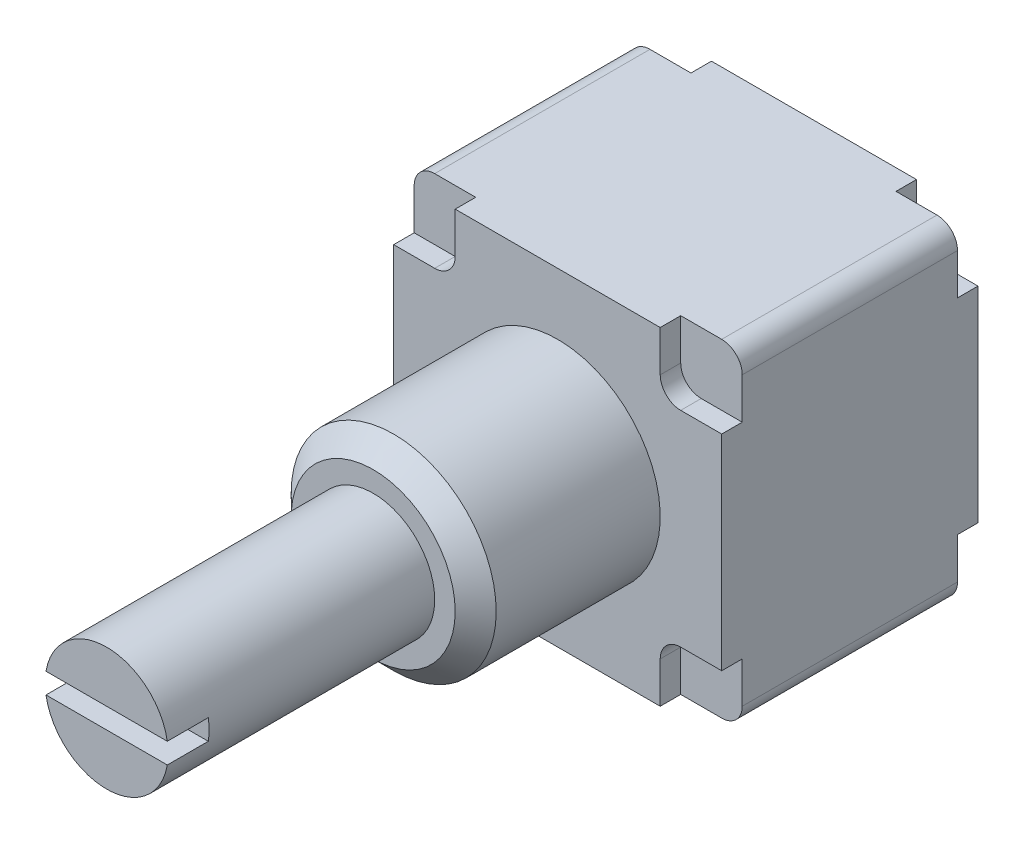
ISO-10303-21;
HEADER;
FILE_DESCRIPTION(('STEP AP214'),'2;1');
FILE_NAME('part.step','',(''),(''),'','','');
FILE_SCHEMA(('AUTOMOTIVE_DESIGN { 1 0 10303 214 1 1 1 1 }'));
ENDSEC;
DATA;
#1=APPLICATION_CONTEXT('core data for automotive mechanical design processes');
#2=APPLICATION_PROTOCOL_DEFINITION('international standard','automotive_design',2000,#1);
#3=PRODUCT_CONTEXT('',#1,'mechanical');
#4=PRODUCT('Part','Part','',(#3));
#5=PRODUCT_RELATED_PRODUCT_CATEGORY('part','',(#4));
#6=PRODUCT_DEFINITION_FORMATION('','',#4);
#7=PRODUCT_DEFINITION_CONTEXT('part definition',#1,'design');
#8=PRODUCT_DEFINITION('design','',#6,#7);
#9=PRODUCT_DEFINITION_SHAPE('','',#8);
#10=(LENGTH_UNIT() NAMED_UNIT(*) SI_UNIT(.MILLI.,.METRE.));
#11=(NAMED_UNIT(*) PLANE_ANGLE_UNIT() SI_UNIT($,.RADIAN.));
#12=(NAMED_UNIT(*) SI_UNIT($,.STERADIAN.) SOLID_ANGLE_UNIT());
#13=UNCERTAINTY_MEASURE_WITH_UNIT(LENGTH_MEASURE(1.E-05),#10,'distance_accuracy_value','');
#14=(GEOMETRIC_REPRESENTATION_CONTEXT(3) GLOBAL_UNCERTAINTY_ASSIGNED_CONTEXT((#13)) GLOBAL_UNIT_ASSIGNED_CONTEXT((#10,
#11,#12)) REPRESENTATION_CONTEXT('',''));
#15=CARTESIAN_POINT('',(0.,0.,0.));
#16=DIRECTION('',(0.,0.,1.));
#17=DIRECTION('',(1.,0.,0.));
#18=AXIS2_PLACEMENT_3D('',#15,#16,#17);
#19=CARTESIAN_POINT('',(1.,1.,12.5));
#20=DIRECTION('',(0.,0.,-1.));
#21=DIRECTION('',(-1.,0.,0.));
#22=AXIS2_PLACEMENT_3D('',#19,#20,#21);
#23=CYLINDRICAL_SURFACE('',#22,1.);
#24=DIRECTION('',(0.,0.,-1.));
#25=VECTOR('',#24,1.);
#26=CARTESIAN_POINT('',(0.,1.,12.5));
#27=LINE('',#26,#25);
#28=CARTESIAN_POINT('',(0.,1.,1.));
#29=VERTEX_POINT('',#28);
#30=CARTESIAN_POINT('',(0.,1.,11.5));
#31=VERTEX_POINT('',#30);
#32=EDGE_CURVE('E382',#29,#31,#27,.F.);
#33=ORIENTED_EDGE('',*,*,#32,.F.);
#34=CARTESIAN_POINT('',(1.,1.,1.));
#35=DIRECTION('',(0.,0.,-1.));
#36=DIRECTION('',(-1.,0.,0.));
#37=AXIS2_PLACEMENT_3D('',#34,#35,#36);
#38=CIRCLE('',#37,1.);
#39=CARTESIAN_POINT('',(1.,0.,1.));
#40=VERTEX_POINT('',#39);
#41=EDGE_CURVE('E1236',#40,#29,#38,.T.);
#42=ORIENTED_EDGE('',*,*,#41,.F.);
#43=DIRECTION('',(0.,0.,-1.));
#44=VECTOR('',#43,1.);
#45=CARTESIAN_POINT('',(1.,0.,12.5));
#46=LINE('',#45,#44);
#47=CARTESIAN_POINT('',(1.,0.,11.5));
#48=VERTEX_POINT('',#47);
#49=EDGE_CURVE('E374',#48,#40,#46,.T.);
#50=ORIENTED_EDGE('',*,*,#49,.F.);
#51=CARTESIAN_POINT('',(1.,1.,11.5));
#52=DIRECTION('',(0.,0.,-1.));
#53=DIRECTION('',(-1.,0.,0.));
#54=AXIS2_PLACEMENT_3D('',#51,#52,#53);
#55=CIRCLE('',#54,1.);
#56=EDGE_CURVE('E431',#31,#48,#55,.F.);
#57=ORIENTED_EDGE('',*,*,#56,.F.);
#58=EDGE_LOOP('',(#33,#42,#50,#57));
#59=FACE_BOUND('',#58,.T.);
#60=ADVANCED_FACE('F38',(#59),#23,.T.);
#61=CARTESIAN_POINT('',(15.,15.,12.5));
#62=DIRECTION('',(0.,0.,-1.));
#63=DIRECTION('',(-1.,0.,0.));
#64=AXIS2_PLACEMENT_3D('',#61,#62,#63);
#65=CYLINDRICAL_SURFACE('',#64,1.);
#66=DIRECTION('',(0.,0.,-1.));
#67=VECTOR('',#66,1.);
#68=CARTESIAN_POINT('',(16.,15.,12.5));
#69=LINE('',#68,#67);
#70=CARTESIAN_POINT('',(16.,15.,1.));
#71=VERTEX_POINT('',#70);
#72=CARTESIAN_POINT('',(16.,15.,11.5));
#73=VERTEX_POINT('',#72);
#74=EDGE_CURVE('E369',#71,#73,#69,.F.);
#75=ORIENTED_EDGE('',*,*,#74,.F.);
#76=CARTESIAN_POINT('',(15.,15.,1.));
#77=DIRECTION('',(0.,0.,-1.));
#78=DIRECTION('',(-1.,0.,0.));
#79=AXIS2_PLACEMENT_3D('',#76,#77,#78);
#80=CIRCLE('',#79,1.);
#81=CARTESIAN_POINT('',(15.,16.,1.));
#82=VERTEX_POINT('',#81);
#83=EDGE_CURVE('E1211',#82,#71,#80,.T.);
#84=ORIENTED_EDGE('',*,*,#83,.F.);
#85=DIRECTION('',(0.,0.,-1.));
#86=VECTOR('',#85,1.);
#87=CARTESIAN_POINT('',(15.,16.,12.5));
#88=LINE('',#87,#86);
#89=CARTESIAN_POINT('',(15.,16.,11.5));
#90=VERTEX_POINT('',#89);
#91=EDGE_CURVE('E386',#90,#82,#88,.T.);
#92=ORIENTED_EDGE('',*,*,#91,.F.);
#93=CARTESIAN_POINT('',(15.,15.,11.5));
#94=DIRECTION('',(0.,0.,-1.));
#95=DIRECTION('',(-1.,0.,0.));
#96=AXIS2_PLACEMENT_3D('',#93,#94,#95);
#97=CIRCLE('',#96,1.);
#98=EDGE_CURVE('E414',#73,#90,#97,.F.);
#99=ORIENTED_EDGE('',*,*,#98,.F.);
#100=EDGE_LOOP('',(#75,#84,#92,#99));
#101=FACE_BOUND('',#100,.T.);
#102=ADVANCED_FACE('F606',(#101),#65,.T.);
#103=CARTESIAN_POINT('',(15.,1.,12.5));
#104=DIRECTION('',(0.,0.,-1.));
#105=DIRECTION('',(-1.,0.,0.));
#106=AXIS2_PLACEMENT_3D('',#103,#104,#105);
#107=CYLINDRICAL_SURFACE('',#106,1.);
#108=DIRECTION('',(0.,0.,-1.));
#109=VECTOR('',#108,1.);
#110=CARTESIAN_POINT('',(15.,0.,12.5));
#111=LINE('',#110,#109);
#112=CARTESIAN_POINT('',(15.,0.,1.));
#113=VERTEX_POINT('',#112);
#114=CARTESIAN_POINT('',(15.,0.,11.5));
#115=VERTEX_POINT('',#114);
#116=EDGE_CURVE('E377',#113,#115,#111,.F.);
#117=ORIENTED_EDGE('',*,*,#116,.F.);
#118=CARTESIAN_POINT('',(15.,1.,1.));
#119=DIRECTION('',(0.,0.,-1.));
#120=DIRECTION('',(-1.,0.,0.));
#121=AXIS2_PLACEMENT_3D('',#118,#119,#120);
#122=CIRCLE('',#121,1.);
#123=CARTESIAN_POINT('',(16.,1.,1.));
#124=VERTEX_POINT('',#123);
#125=EDGE_CURVE('E1170',#124,#113,#122,.T.);
#126=ORIENTED_EDGE('',*,*,#125,.F.);
#127=DIRECTION('',(0.,0.,-1.));
#128=VECTOR('',#127,1.);
#129=CARTESIAN_POINT('',(16.,1.,12.5));
#130=LINE('',#129,#128);
#131=CARTESIAN_POINT('',(16.,1.,11.5));
#132=VERTEX_POINT('',#131);
#133=EDGE_CURVE('E371',#132,#124,#130,.T.);
#134=ORIENTED_EDGE('',*,*,#133,.F.);
#135=CARTESIAN_POINT('',(15.,1.,11.5));
#136=DIRECTION('',(0.,0.,1.));
#137=DIRECTION('',(1.,0.,0.));
#138=AXIS2_PLACEMENT_3D('',#135,#136,#137);
#139=CIRCLE('',#138,1.);
#140=EDGE_CURVE('E422',#132,#115,#139,.F.);
#141=ORIENTED_EDGE('',*,*,#140,.T.);
#142=EDGE_LOOP('',(#117,#126,#134,#141));
#143=FACE_BOUND('',#142,.T.);
#144=ADVANCED_FACE('F612',(#143),#107,.T.);
#145=CARTESIAN_POINT('',(1.,15.,12.5));
#146=DIRECTION('',(0.,0.,-1.));
#147=DIRECTION('',(-1.,0.,0.));
#148=AXIS2_PLACEMENT_3D('',#145,#146,#147);
#149=CYLINDRICAL_SURFACE('',#148,1.);
#150=DIRECTION('',(0.,0.,-1.));
#151=VECTOR('',#150,1.);
#152=CARTESIAN_POINT('',(1.,16.,12.5));
#153=LINE('',#152,#151);
#154=CARTESIAN_POINT('',(1.,16.,1.));
#155=VERTEX_POINT('',#154);
#156=CARTESIAN_POINT('',(1.,16.,11.5));
#157=VERTEX_POINT('',#156);
#158=EDGE_CURVE('E384',#155,#157,#153,.F.);
#159=ORIENTED_EDGE('',*,*,#158,.F.);
#160=CARTESIAN_POINT('',(1.,15.,1.));
#161=DIRECTION('',(0.,0.,-1.));
#162=DIRECTION('',(-1.,0.,0.));
#163=AXIS2_PLACEMENT_3D('',#160,#161,#162);
#164=CIRCLE('',#163,1.);
#165=CARTESIAN_POINT('',(0.,15.,1.));
#166=VERTEX_POINT('',#165);
#167=EDGE_CURVE('E1117',#166,#155,#164,.T.);
#168=ORIENTED_EDGE('',*,*,#167,.F.);
#169=DIRECTION('',(0.,0.,-1.));
#170=VECTOR('',#169,1.);
#171=CARTESIAN_POINT('',(0.,15.,12.5));
#172=LINE('',#171,#170);
#173=CARTESIAN_POINT('',(0.,15.,11.5));
#174=VERTEX_POINT('',#173);
#175=EDGE_CURVE('E379',#174,#166,#172,.T.);
#176=ORIENTED_EDGE('',*,*,#175,.F.);
#177=CARTESIAN_POINT('',(1.,15.,11.5));
#178=DIRECTION('',(0.,0.,1.));
#179=DIRECTION('',(1.,0.,0.));
#180=AXIS2_PLACEMENT_3D('',#177,#178,#179);
#181=CIRCLE('',#180,1.);
#182=EDGE_CURVE('E405',#174,#157,#181,.F.);
#183=ORIENTED_EDGE('',*,*,#182,.T.);
#184=EDGE_LOOP('',(#159,#168,#176,#183));
#185=FACE_BOUND('',#184,.T.);
#186=ADVANCED_FACE('F620',(#185),#149,.T.);
#187=CARTESIAN_POINT('',(8.,8.,34.5));
#188=DIRECTION('',(0.,0.,1.));
#189=DIRECTION('',(1.,0.,0.));
#190=AXIS2_PLACEMENT_3D('',#187,#188,#189);
#191=PLANE('',#190);
#192=DIRECTION('',(-1.,0.,0.));
#193=VECTOR('',#192,1.);
#194=CARTESIAN_POINT('',(8.,8.5,34.5));
#195=LINE('',#194,#193);
#196=CARTESIAN_POINT('',(10.9580398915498,8.5,34.5));
#197=VERTEX_POINT('',#196);
#198=CARTESIAN_POINT('',(5.04196010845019,8.5,34.5));
#199=VERTEX_POINT('',#198);
#200=EDGE_CURVE('E400',#197,#199,#195,.T.);
#201=ORIENTED_EDGE('',*,*,#200,.F.);
#202=CARTESIAN_POINT('',(8.,8.,34.5));
#203=DIRECTION('',(0.,0.,1.));
#204=DIRECTION('',(1.,0.,0.));
#205=AXIS2_PLACEMENT_3D('',#202,#203,#204);
#206=CIRCLE('',#205,3.);
#207=EDGE_CURVE('E347',#197,#199,#206,.T.);
#208=ORIENTED_EDGE('',*,*,#207,.T.);
#209=EDGE_LOOP('',(#201,#208));
#210=FACE_BOUND('',#209,.T.);
#211=ADVANCED_FACE('F594',(#210),#191,.T.);
#212=CARTESIAN_POINT('',(8.,8.,21.5));
#213=DIRECTION('',(0.,0.,1.));
#214=DIRECTION('',(1.,0.,0.));
#215=AXIS2_PLACEMENT_3D('',#212,#213,#214);
#216=PLANE('',#215);
#217=CARTESIAN_POINT('',(8.,8.,21.5));
#218=DIRECTION('',(0.,0.,1.));
#219=DIRECTION('',(1.,0.,0.));
#220=AXIS2_PLACEMENT_3D('',#217,#218,#219);
#221=CIRCLE('',#220,3.99999999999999);
#222=CARTESIAN_POINT('',(12.,8.,21.5));
#223=VERTEX_POINT('',#222);
#224=EDGE_CURVE('E392',#223,#223,#221,.T.);
#225=ORIENTED_EDGE('',*,*,#224,.T.);
#226=EDGE_LOOP('',(#225));
#227=FACE_BOUND('',#226,.T.);
#228=CARTESIAN_POINT('',(8.,8.,21.5));
#229=DIRECTION('',(0.,0.,1.));
#230=DIRECTION('',(1.,0.,0.));
#231=AXIS2_PLACEMENT_3D('',#228,#229,#230);
#232=CIRCLE('',#231,3.);
#233=CARTESIAN_POINT('',(11.,8.,21.5));
#234=VERTEX_POINT('',#233);
#235=EDGE_CURVE('E571',#234,#234,#232,.T.);
#236=ORIENTED_EDGE('',*,*,#235,.F.);
#237=EDGE_LOOP('',(#236));
#238=FACE_BOUND('',#237,.T.);
#239=ADVANCED_FACE('F628',(#227,#238),#216,.T.);
#240=CARTESIAN_POINT('',(0.,16.,12.5));
#241=DIRECTION('',(0.,0.,-1.));
#242=DIRECTION('',(-1.,0.,0.));
#243=AXIS2_PLACEMENT_3D('',#240,#241,#242);
#244=PLANE('',#243);
#245=CARTESIAN_POINT('',(2.,2.,12.5));
#246=DIRECTION('',(0.,0.,1.));
#247=DIRECTION('',(-1.,0.,0.));
#248=AXIS2_PLACEMENT_3D('',#245,#246,#247);
#249=CIRCLE('',#248,1.);
#250=CARTESIAN_POINT('',(3.,1.99999999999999,12.5));
#251=VERTEX_POINT('',#250);
#252=CARTESIAN_POINT('',(1.99999999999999,3.,12.5));
#253=VERTEX_POINT('',#252);
#254=EDGE_CURVE('E455',#251,#253,#249,.T.);
#255=ORIENTED_EDGE('',*,*,#254,.F.);
#256=DIRECTION('',(0.,1.,0.));
#257=VECTOR('',#256,1.);
#258=CARTESIAN_POINT('',(2.99999999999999,-1.6785120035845,12.5));
#259=LINE('',#258,#257);
#260=CARTESIAN_POINT('',(2.99999999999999,0.,12.5));
#261=VERTEX_POINT('',#260);
#262=EDGE_CURVE('E444',#261,#251,#259,.T.);
#263=ORIENTED_EDGE('',*,*,#262,.F.);
#264=DIRECTION('',(1.,0.,0.));
#265=VECTOR('',#264,1.);
#266=CARTESIAN_POINT('',(0.,0.,12.5));
#267=LINE('',#266,#265);
#268=CARTESIAN_POINT('',(13.,0.,12.5));
#269=VERTEX_POINT('',#268);
#270=EDGE_CURVE('E363',#261,#269,#267,.T.);
#271=ORIENTED_EDGE('',*,*,#270,.T.);
#272=DIRECTION('',(0.,-1.,0.));
#273=VECTOR('',#272,1.);
#274=CARTESIAN_POINT('',(13.,-1.6785120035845,12.5));
#275=LINE('',#274,#273);
#276=CARTESIAN_POINT('',(13.,1.99999999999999,12.5));
#277=VERTEX_POINT('',#276);
#278=EDGE_CURVE('E479',#277,#269,#275,.T.);
#279=ORIENTED_EDGE('',*,*,#278,.F.);
#280=CARTESIAN_POINT('',(14.,2.,12.5));
#281=DIRECTION('',(0.,0.,1.));
#282=DIRECTION('',(1.,0.,0.));
#283=AXIS2_PLACEMENT_3D('',#280,#281,#282);
#284=CIRCLE('',#283,1.);
#285=CARTESIAN_POINT('',(14.,3.,12.5));
#286=VERTEX_POINT('',#285);
#287=EDGE_CURVE('E476',#286,#277,#284,.T.);
#288=ORIENTED_EDGE('',*,*,#287,.F.);
#289=DIRECTION('',(-1.,0.,0.));
#290=VECTOR('',#289,1.);
#291=CARTESIAN_POINT('',(16.8069329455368,3.,12.5));
#292=LINE('',#291,#290);
#293=CARTESIAN_POINT('',(16.,3.,12.5));
#294=VERTEX_POINT('',#293);
#295=EDGE_CURVE('E481',#294,#286,#292,.T.);
#296=ORIENTED_EDGE('',*,*,#295,.F.);
#297=DIRECTION('',(0.,1.,0.));
#298=VECTOR('',#297,1.);
#299=CARTESIAN_POINT('',(16.,0.,12.5));
#300=LINE('',#299,#298);
#301=CARTESIAN_POINT('',(16.,13.,12.5));
#302=VERTEX_POINT('',#301);
#303=EDGE_CURVE('E365',#294,#302,#300,.T.);
#304=ORIENTED_EDGE('',*,*,#303,.T.);
#305=DIRECTION('',(1.,0.,0.));
#306=VECTOR('',#305,1.);
#307=CARTESIAN_POINT('',(16.8069329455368,13.,12.5));
#308=LINE('',#307,#306);
#309=CARTESIAN_POINT('',(14.,13.,12.5));
#310=VERTEX_POINT('',#309);
#311=EDGE_CURVE('E504',#310,#302,#308,.T.);
#312=ORIENTED_EDGE('',*,*,#311,.F.);
#313=CARTESIAN_POINT('',(14.,14.,12.5));
#314=DIRECTION('',(0.,0.,1.));
#315=DIRECTION('',(-1.,0.,0.));
#316=AXIS2_PLACEMENT_3D('',#313,#314,#315);
#317=CIRCLE('',#316,1.);
#318=CARTESIAN_POINT('',(13.,14.,12.5));
#319=VERTEX_POINT('',#318);
#320=EDGE_CURVE('E501',#319,#310,#317,.T.);
#321=ORIENTED_EDGE('',*,*,#320,.F.);
#322=DIRECTION('',(0.,-1.,0.));
#323=VECTOR('',#322,1.);
#324=CARTESIAN_POINT('',(13.,17.6785120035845,12.5));
#325=LINE('',#324,#323);
#326=CARTESIAN_POINT('',(13.,16.,12.5));
#327=VERTEX_POINT('',#326);
#328=EDGE_CURVE('E507',#327,#319,#325,.T.);
#329=ORIENTED_EDGE('',*,*,#328,.F.);
#330=DIRECTION('',(-1.,0.,0.));
#331=VECTOR('',#330,1.);
#332=CARTESIAN_POINT('',(0.,16.,12.5));
#333=LINE('',#332,#331);
#334=CARTESIAN_POINT('',(3.,16.,12.5));
#335=VERTEX_POINT('',#334);
#336=EDGE_CURVE('E367',#327,#335,#333,.T.);
#337=ORIENTED_EDGE('',*,*,#336,.T.);
#338=DIRECTION('',(0.,1.,0.));
#339=VECTOR('',#338,1.);
#340=CARTESIAN_POINT('',(3.,17.6785120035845,12.5));
#341=LINE('',#340,#339);
#342=CARTESIAN_POINT('',(3.,14.,12.5));
#343=VERTEX_POINT('',#342);
#344=EDGE_CURVE('E533',#343,#335,#341,.T.);
#345=ORIENTED_EDGE('',*,*,#344,.F.);
#346=CARTESIAN_POINT('',(2.,14.,12.5));
#347=DIRECTION('',(0.,0.,1.));
#348=DIRECTION('',(1.,0.,0.));
#349=AXIS2_PLACEMENT_3D('',#346,#347,#348);
#350=CIRCLE('',#349,1.);
#351=CARTESIAN_POINT('',(1.99999999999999,13.,12.5));
#352=VERTEX_POINT('',#351);
#353=EDGE_CURVE('E530',#352,#343,#350,.T.);
#354=ORIENTED_EDGE('',*,*,#353,.F.);
#355=DIRECTION('',(1.,0.,0.));
#356=VECTOR('',#355,1.);
#357=CARTESIAN_POINT('',(-0.8069329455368,13.,12.5));
#358=LINE('',#357,#356);
#359=CARTESIAN_POINT('',(0.,13.,12.5));
#360=VERTEX_POINT('',#359);
#361=EDGE_CURVE('E528',#360,#352,#358,.T.);
#362=ORIENTED_EDGE('',*,*,#361,.F.);
#363=DIRECTION('',(0.,-1.,0.));
#364=VECTOR('',#363,1.);
#365=CARTESIAN_POINT('',(0.,0.,12.5));
#366=LINE('',#365,#364);
#367=CARTESIAN_POINT('',(0.,3.,12.5));
#368=VERTEX_POINT('',#367);
#369=EDGE_CURVE('E360',#360,#368,#366,.T.);
#370=ORIENTED_EDGE('',*,*,#369,.T.);
#371=DIRECTION('',(-1.,0.,0.));
#372=VECTOR('',#371,1.);
#373=CARTESIAN_POINT('',(-0.8069329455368,3.,12.5));
#374=LINE('',#373,#372);
#375=EDGE_CURVE('E457',#253,#368,#374,.T.);
#376=ORIENTED_EDGE('',*,*,#375,.F.);
#377=EDGE_LOOP('',(#255,#263,#271,#279,#288,#296,#304,#312,#321,#329,#337,#345,#354,#362,#370,#376));
#378=FACE_BOUND('',#377,.T.);
#379=CARTESIAN_POINT('',(8.,8.,12.5));
#380=DIRECTION('',(0.,0.,-1.));
#381=DIRECTION('',(-1.,0.,0.));
#382=AXIS2_PLACEMENT_3D('',#379,#380,#381);
#383=CIRCLE('',#382,5.);
#384=CARTESIAN_POINT('',(3.,8.,12.5));
#385=VERTEX_POINT('',#384);
#386=EDGE_CURVE('E389',#385,#385,#383,.F.);
#387=ORIENTED_EDGE('',*,*,#386,.F.);
#388=EDGE_LOOP('',(#387));
#389=FACE_BOUND('',#388,.T.);
#390=ADVANCED_FACE('F449',(#378,#389),#244,.F.);
#391=CARTESIAN_POINT('',(0.,0.,12.5));
#392=DIRECTION('',(1.,0.,0.));
#393=DIRECTION('',(0.,0.,-1.));
#394=AXIS2_PLACEMENT_3D('',#391,#392,#393);
#395=PLANE('',#394);
#396=DIRECTION('',(0.,-1.,0.));
#397=VECTOR('',#396,1.);
#398=CARTESIAN_POINT('',(0.,0.,0.));
#399=LINE('',#398,#397);
#400=CARTESIAN_POINT('',(0.,13.,0.));
#401=VERTEX_POINT('',#400);
#402=CARTESIAN_POINT('',(0.,3.,0.));
#403=VERTEX_POINT('',#402);
#404=EDGE_CURVE('E339',#401,#403,#399,.T.);
#405=ORIENTED_EDGE('',*,*,#404,.T.);
#406=DIRECTION('',(0.,0.,-1.));
#407=VECTOR('',#406,1.);
#408=CARTESIAN_POINT('',(0.,3.,1.));
#409=LINE('',#408,#407);
#410=CARTESIAN_POINT('',(0.,3.,1.));
#411=VERTEX_POINT('',#410);
#412=EDGE_CURVE('E321',#411,#403,#409,.T.);
#413=ORIENTED_EDGE('',*,*,#412,.F.);
#414=DIRECTION('',(0.,1.,0.));
#415=VECTOR('',#414,1.);
#416=CARTESIAN_POINT('',(0.,1.,1.));
#417=LINE('',#416,#415);
#418=EDGE_CURVE('E1234',#29,#411,#417,.T.);
#419=ORIENTED_EDGE('',*,*,#418,.F.);
#420=ORIENTED_EDGE('',*,*,#32,.T.);
#421=DIRECTION('',(0.,1.,0.));
#422=VECTOR('',#421,1.);
#423=CARTESIAN_POINT('',(0.,0.,11.5));
#424=LINE('',#423,#422);
#425=CARTESIAN_POINT('',(0.,3.,11.5));
#426=VERTEX_POINT('',#425);
#427=EDGE_CURVE('E473',#31,#426,#424,.T.);
#428=ORIENTED_EDGE('',*,*,#427,.T.);
#429=DIRECTION('',(0.,0.,1.));
#430=VECTOR('',#429,1.);
#431=CARTESIAN_POINT('',(0.,3.,12.5));
#432=LINE('',#431,#430);
#433=EDGE_CURVE('E11',#426,#368,#432,.T.);
#434=ORIENTED_EDGE('',*,*,#433,.T.);
#435=ORIENTED_EDGE('',*,*,#369,.F.);
#436=DIRECTION('',(0.,0.,-1.));
#437=VECTOR('',#436,1.);
#438=CARTESIAN_POINT('',(0.,13.,12.5));
#439=LINE('',#438,#437);
#440=CARTESIAN_POINT('',(0.,13.,11.5));
#441=VERTEX_POINT('',#440);
#442=EDGE_CURVE('E411',#360,#441,#439,.T.);
#443=ORIENTED_EDGE('',*,*,#442,.T.);
#444=DIRECTION('',(0.,-1.,0.));
#445=VECTOR('',#444,1.);
#446=CARTESIAN_POINT('',(0.,0.,11.5));
#447=LINE('',#446,#445);
#448=EDGE_CURVE('E552',#174,#441,#447,.T.);
#449=ORIENTED_EDGE('',*,*,#448,.F.);
#450=ORIENTED_EDGE('',*,*,#175,.T.);
#451=DIRECTION('',(0.,1.,0.));
#452=VECTOR('',#451,1.);
#453=CARTESIAN_POINT('',(0.,13.,1.));
#454=LINE('',#453,#452);
#455=CARTESIAN_POINT('',(0.,13.,1.));
#456=VERTEX_POINT('',#455);
#457=EDGE_CURVE('E1118',#456,#166,#454,.T.);
#458=ORIENTED_EDGE('',*,*,#457,.F.);
#459=DIRECTION('',(0.,0.,-1.));
#460=VECTOR('',#459,1.);
#461=CARTESIAN_POINT('',(0.,13.,1.));
#462=LINE('',#461,#460);
#463=EDGE_CURVE('E345',#456,#401,#462,.T.);
#464=ORIENTED_EDGE('',*,*,#463,.T.);
#465=EDGE_LOOP('',(#405,#413,#419,#420,#428,#434,#435,#443,#449,#450,#458,#464));
#466=FACE_BOUND('',#465,.T.);
#467=ADVANCED_FACE('F40',(#466),#395,.F.);
#468=CARTESIAN_POINT('',(0.,0.,12.5));
#469=DIRECTION('',(0.,1.,0.));
#470=DIRECTION('',(0.,0.,1.));
#471=AXIS2_PLACEMENT_3D('',#468,#469,#470);
#472=PLANE('',#471);
#473=DIRECTION('',(-1.,0.,0.));
#474=VECTOR('',#473,1.);
#475=CARTESIAN_POINT('',(2.99999999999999,0.,1.));
#476=LINE('',#475,#474);
#477=CARTESIAN_POINT('',(2.99999999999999,0.,1.));
#478=VERTEX_POINT('',#477);
#479=EDGE_CURVE('E53',#478,#40,#476,.T.);
#480=ORIENTED_EDGE('',*,*,#479,.F.);
#481=DIRECTION('',(0.,0.,-1.));
#482=VECTOR('',#481,1.);
#483=CARTESIAN_POINT('',(2.99999999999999,0.,1.));
#484=LINE('',#483,#482);
#485=CARTESIAN_POINT('',(2.99999999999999,0.,0.));
#486=VERTEX_POINT('',#485);
#487=EDGE_CURVE('E1220',#478,#486,#484,.T.);
#488=ORIENTED_EDGE('',*,*,#487,.T.);
#489=DIRECTION('',(1.,0.,0.));
#490=VECTOR('',#489,1.);
#491=CARTESIAN_POINT('',(0.,0.,0.));
#492=LINE('',#491,#490);
#493=CARTESIAN_POINT('',(13.,0.,0.));
#494=VERTEX_POINT('',#493);
#495=EDGE_CURVE('E346',#486,#494,#492,.T.);
#496=ORIENTED_EDGE('',*,*,#495,.T.);
#497=DIRECTION('',(0.,0.,-1.));
#498=VECTOR('',#497,1.);
#499=CARTESIAN_POINT('',(13.,0.,1.));
#500=LINE('',#499,#498);
#501=CARTESIAN_POINT('',(13.,0.,1.));
#502=VERTEX_POINT('',#501);
#503=EDGE_CURVE('E1156',#502,#494,#500,.T.);
#504=ORIENTED_EDGE('',*,*,#503,.F.);
#505=DIRECTION('',(-1.,0.,0.));
#506=VECTOR('',#505,1.);
#507=CARTESIAN_POINT('',(15.,0.,1.));
#508=LINE('',#507,#506);
#509=EDGE_CURVE('E1161',#113,#502,#508,.T.);
#510=ORIENTED_EDGE('',*,*,#509,.F.);
#511=ORIENTED_EDGE('',*,*,#116,.T.);
#512=DIRECTION('',(1.,0.,0.));
#513=VECTOR('',#512,1.);
#514=CARTESIAN_POINT('',(0.,0.,11.5));
#515=LINE('',#514,#513);
#516=CARTESIAN_POINT('',(13.,0.,11.5));
#517=VERTEX_POINT('',#516);
#518=EDGE_CURVE('E498',#517,#115,#515,.T.);
#519=ORIENTED_EDGE('',*,*,#518,.F.);
#520=DIRECTION('',(0.,0.,1.));
#521=VECTOR('',#520,1.);
#522=CARTESIAN_POINT('',(13.,0.,12.5));
#523=LINE('',#522,#521);
#524=EDGE_CURVE('E428',#517,#269,#523,.T.);
#525=ORIENTED_EDGE('',*,*,#524,.T.);
#526=ORIENTED_EDGE('',*,*,#270,.F.);
#527=DIRECTION('',(0.,0.,-1.));
#528=VECTOR('',#527,1.);
#529=CARTESIAN_POINT('',(2.99999999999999,0.,12.5));
#530=LINE('',#529,#528);
#531=CARTESIAN_POINT('',(2.99999999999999,0.,11.5));
#532=VERTEX_POINT('',#531);
#533=EDGE_CURVE('E46',#261,#532,#530,.T.);
#534=ORIENTED_EDGE('',*,*,#533,.T.);
#535=DIRECTION('',(-1.,0.,0.));
#536=VECTOR('',#535,1.);
#537=CARTESIAN_POINT('',(0.,0.,11.5));
#538=LINE('',#537,#536);
#539=EDGE_CURVE('E437',#532,#48,#538,.T.);
#540=ORIENTED_EDGE('',*,*,#539,.T.);
#541=ORIENTED_EDGE('',*,*,#49,.T.);
#542=EDGE_LOOP('',(#480,#488,#496,#504,#510,#511,#519,#525,#526,#534,#540,#541));
#543=FACE_BOUND('',#542,.T.);
#544=ADVANCED_FACE('F436',(#543),#472,.F.);
#545=CARTESIAN_POINT('',(16.,0.,12.5));
#546=DIRECTION('',(-1.,0.,0.));
#547=DIRECTION('',(0.,0.,1.));
#548=AXIS2_PLACEMENT_3D('',#545,#546,#547);
#549=PLANE('',#548);
#550=DIRECTION('',(0.,1.,0.));
#551=VECTOR('',#550,1.);
#552=CARTESIAN_POINT('',(16.,0.,0.));
#553=LINE('',#552,#551);
#554=CARTESIAN_POINT('',(16.,3.,0.));
#555=VERTEX_POINT('',#554);
#556=CARTESIAN_POINT('',(16.,13.,0.));
#557=VERTEX_POINT('',#556);
#558=EDGE_CURVE('E349',#555,#557,#553,.T.);
#559=ORIENTED_EDGE('',*,*,#558,.T.);
#560=DIRECTION('',(0.,0.,-1.));
#561=VECTOR('',#560,1.);
#562=CARTESIAN_POINT('',(16.,13.,1.));
#563=LINE('',#562,#561);
#564=CARTESIAN_POINT('',(16.,13.,1.));
#565=VERTEX_POINT('',#564);
#566=EDGE_CURVE('E1191',#565,#557,#563,.T.);
#567=ORIENTED_EDGE('',*,*,#566,.F.);
#568=DIRECTION('',(0.,-1.,0.));
#569=VECTOR('',#568,1.);
#570=CARTESIAN_POINT('',(16.,15.,1.));
#571=LINE('',#570,#569);
#572=EDGE_CURVE('E1208',#71,#565,#571,.T.);
#573=ORIENTED_EDGE('',*,*,#572,.F.);
#574=ORIENTED_EDGE('',*,*,#74,.T.);
#575=DIRECTION('',(0.,-1.,0.));
#576=VECTOR('',#575,1.);
#577=CARTESIAN_POINT('',(16.,0.,11.5));
#578=LINE('',#577,#576);
#579=CARTESIAN_POINT('',(16.,13.,11.5));
#580=VERTEX_POINT('',#579);
#581=EDGE_CURVE('E525',#73,#580,#578,.T.);
#582=ORIENTED_EDGE('',*,*,#581,.T.);
#583=DIRECTION('',(0.,0.,1.));
#584=VECTOR('',#583,1.);
#585=CARTESIAN_POINT('',(16.,13.,12.5));
#586=LINE('',#585,#584);
#587=EDGE_CURVE('E419',#580,#302,#586,.T.);
#588=ORIENTED_EDGE('',*,*,#587,.T.);
#589=ORIENTED_EDGE('',*,*,#303,.F.);
#590=DIRECTION('',(0.,0.,-1.));
#591=VECTOR('',#590,1.);
#592=CARTESIAN_POINT('',(16.,3.,12.5));
#593=LINE('',#592,#591);
#594=CARTESIAN_POINT('',(16.,3.,11.5));
#595=VERTEX_POINT('',#594);
#596=EDGE_CURVE('E425',#294,#595,#593,.T.);
#597=ORIENTED_EDGE('',*,*,#596,.T.);
#598=DIRECTION('',(0.,1.,0.));
#599=VECTOR('',#598,1.);
#600=CARTESIAN_POINT('',(16.,0.,11.5));
#601=LINE('',#600,#599);
#602=EDGE_CURVE('E495',#132,#595,#601,.T.);
#603=ORIENTED_EDGE('',*,*,#602,.F.);
#604=ORIENTED_EDGE('',*,*,#133,.T.);
#605=DIRECTION('',(0.,-1.,0.));
#606=VECTOR('',#605,1.);
#607=CARTESIAN_POINT('',(16.,3.,1.));
#608=LINE('',#607,#606);
#609=CARTESIAN_POINT('',(16.,3.,1.));
#610=VERTEX_POINT('',#609);
#611=EDGE_CURVE('E1172',#610,#124,#608,.T.);
#612=ORIENTED_EDGE('',*,*,#611,.F.);
#613=DIRECTION('',(0.,0.,-1.));
#614=VECTOR('',#613,1.);
#615=CARTESIAN_POINT('',(16.,3.,1.));
#616=LINE('',#615,#614);
#617=EDGE_CURVE('E1163',#610,#555,#616,.T.);
#618=ORIENTED_EDGE('',*,*,#617,.T.);
#619=EDGE_LOOP('',(#559,#567,#573,#574,#582,#588,#589,#597,#603,#604,#612,#618));
#620=FACE_BOUND('',#619,.T.);
#621=ADVANCED_FACE('F631',(#620),#549,.F.);
#622=CARTESIAN_POINT('',(0.,16.,12.5));
#623=DIRECTION('',(0.,-1.,0.));
#624=DIRECTION('',(0.,0.,-1.));
#625=AXIS2_PLACEMENT_3D('',#622,#623,#624);
#626=PLANE('',#625);
#627=DIRECTION('',(1.,0.,0.));
#628=VECTOR('',#627,1.);
#629=CARTESIAN_POINT('',(13.,16.,1.));
#630=LINE('',#629,#628);
#631=CARTESIAN_POINT('',(13.,16.,1.));
#632=VERTEX_POINT('',#631);
#633=EDGE_CURVE('E61',#632,#82,#630,.T.);
#634=ORIENTED_EDGE('',*,*,#633,.F.);
#635=DIRECTION('',(0.,0.,-1.));
#636=VECTOR('',#635,1.);
#637=CARTESIAN_POINT('',(13.,16.,1.));
#638=LINE('',#637,#636);
#639=CARTESIAN_POINT('',(13.,16.,0.));
#640=VERTEX_POINT('',#639);
#641=EDGE_CURVE('E1190',#632,#640,#638,.T.);
#642=ORIENTED_EDGE('',*,*,#641,.T.);
#643=DIRECTION('',(-1.,0.,0.));
#644=VECTOR('',#643,1.);
#645=CARTESIAN_POINT('',(0.,16.,0.));
#646=LINE('',#645,#644);
#647=CARTESIAN_POINT('',(3.,16.,0.));
#648=VERTEX_POINT('',#647);
#649=EDGE_CURVE('E358',#640,#648,#646,.T.);
#650=ORIENTED_EDGE('',*,*,#649,.T.);
#651=DIRECTION('',(0.,0.,-1.));
#652=VECTOR('',#651,1.);
#653=CARTESIAN_POINT('',(3.,16.,1.));
#654=LINE('',#653,#652);
#655=CARTESIAN_POINT('',(3.,16.,1.));
#656=VERTEX_POINT('',#655);
#657=EDGE_CURVE('E1128',#656,#648,#654,.T.);
#658=ORIENTED_EDGE('',*,*,#657,.F.);
#659=DIRECTION('',(1.,0.,0.));
#660=VECTOR('',#659,1.);
#661=CARTESIAN_POINT('',(1.,16.,1.));
#662=LINE('',#661,#660);
#663=EDGE_CURVE('E1144',#155,#656,#662,.T.);
#664=ORIENTED_EDGE('',*,*,#663,.F.);
#665=ORIENTED_EDGE('',*,*,#158,.T.);
#666=DIRECTION('',(-1.,0.,0.));
#667=VECTOR('',#666,1.);
#668=CARTESIAN_POINT('',(0.,16.,11.5));
#669=LINE('',#668,#667);
#670=CARTESIAN_POINT('',(3.,16.,11.5));
#671=VERTEX_POINT('',#670);
#672=EDGE_CURVE('E547',#671,#157,#669,.T.);
#673=ORIENTED_EDGE('',*,*,#672,.F.);
#674=DIRECTION('',(0.,0.,1.));
#675=VECTOR('',#674,1.);
#676=CARTESIAN_POINT('',(3.,16.,12.5));
#677=LINE('',#676,#675);
#678=EDGE_CURVE('E408',#671,#335,#677,.T.);
#679=ORIENTED_EDGE('',*,*,#678,.T.);
#680=ORIENTED_EDGE('',*,*,#336,.F.);
#681=DIRECTION('',(0.,0.,-1.));
#682=VECTOR('',#681,1.);
#683=CARTESIAN_POINT('',(13.,16.,12.5));
#684=LINE('',#683,#682);
#685=CARTESIAN_POINT('',(13.,16.,11.5));
#686=VERTEX_POINT('',#685);
#687=EDGE_CURVE('E416',#327,#686,#684,.T.);
#688=ORIENTED_EDGE('',*,*,#687,.T.);
#689=DIRECTION('',(1.,0.,0.));
#690=VECTOR('',#689,1.);
#691=CARTESIAN_POINT('',(0.,16.,11.5));
#692=LINE('',#691,#690);
#693=EDGE_CURVE('E521',#686,#90,#692,.T.);
#694=ORIENTED_EDGE('',*,*,#693,.T.);
#695=ORIENTED_EDGE('',*,*,#91,.T.);
#696=EDGE_LOOP('',(#634,#642,#650,#658,#664,#665,#673,#679,#680,#688,#694,#695));
#697=FACE_BOUND('',#696,.T.);
#698=ADVANCED_FACE('F625',(#697),#626,.F.);
#699=CARTESIAN_POINT('',(0.,16.,0.));
#700=DIRECTION('',(0.,0.,-1.));
#701=DIRECTION('',(-1.,0.,0.));
#702=AXIS2_PLACEMENT_3D('',#699,#700,#701);
#703=PLANE('',#702);
#704=DIRECTION('',(0.,-1.,0.));
#705=VECTOR('',#704,1.);
#706=CARTESIAN_POINT('',(3.,1.99999999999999,0.));
#707=LINE('',#706,#705);
#708=CARTESIAN_POINT('',(3.,1.99999999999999,0.));
#709=VERTEX_POINT('',#708);
#710=EDGE_CURVE('E1238',#709,#486,#707,.T.);
#711=ORIENTED_EDGE('',*,*,#710,.F.);
#712=CARTESIAN_POINT('',(2.,2.,0.));
#713=DIRECTION('',(0.,0.,-1.));
#714=DIRECTION('',(-1.,0.,0.));
#715=AXIS2_PLACEMENT_3D('',#712,#713,#714);
#716=CIRCLE('',#715,0.999999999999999);
#717=CARTESIAN_POINT('',(1.99999999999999,3.,0.));
#718=VERTEX_POINT('',#717);
#719=EDGE_CURVE('E341',#718,#709,#716,.T.);
#720=ORIENTED_EDGE('',*,*,#719,.F.);
#721=DIRECTION('',(1.,0.,0.));
#722=VECTOR('',#721,1.);
#723=CARTESIAN_POINT('',(0.,3.,0.));
#724=LINE('',#723,#722);
#725=EDGE_CURVE('E324',#403,#718,#724,.T.);
#726=ORIENTED_EDGE('',*,*,#725,.F.);
#727=ORIENTED_EDGE('',*,*,#404,.F.);
#728=DIRECTION('',(-1.,0.,0.));
#729=VECTOR('',#728,1.);
#730=CARTESIAN_POINT('',(1.99999999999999,13.,0.));
#731=LINE('',#730,#729);
#732=CARTESIAN_POINT('',(1.99999999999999,13.,0.));
#733=VERTEX_POINT('',#732);
#734=EDGE_CURVE('E1148',#733,#401,#731,.T.);
#735=ORIENTED_EDGE('',*,*,#734,.F.);
#736=CARTESIAN_POINT('',(2.,14.,0.));
#737=DIRECTION('',(0.,0.,-1.));
#738=DIRECTION('',(-1.,0.,0.));
#739=AXIS2_PLACEMENT_3D('',#736,#737,#738);
#740=CIRCLE('',#739,0.999999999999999);
#741=CARTESIAN_POINT('',(3.,14.,0.));
#742=VERTEX_POINT('',#741);
#743=EDGE_CURVE('E1150',#742,#733,#740,.T.);
#744=ORIENTED_EDGE('',*,*,#743,.F.);
#745=DIRECTION('',(0.,-1.,0.));
#746=VECTOR('',#745,1.);
#747=CARTESIAN_POINT('',(3.,16.,0.));
#748=LINE('',#747,#746);
#749=EDGE_CURVE('E1153',#648,#742,#748,.T.);
#750=ORIENTED_EDGE('',*,*,#749,.F.);
#751=ORIENTED_EDGE('',*,*,#649,.F.);
#752=DIRECTION('',(0.,1.,0.));
#753=VECTOR('',#752,1.);
#754=CARTESIAN_POINT('',(13.,14.,0.));
#755=LINE('',#754,#753);
#756=CARTESIAN_POINT('',(13.,14.,0.));
#757=VERTEX_POINT('',#756);
#758=EDGE_CURVE('E1213',#757,#640,#755,.T.);
#759=ORIENTED_EDGE('',*,*,#758,.F.);
#760=CARTESIAN_POINT('',(14.,14.,0.));
#761=DIRECTION('',(0.,0.,-1.));
#762=DIRECTION('',(-1.,0.,0.));
#763=AXIS2_PLACEMENT_3D('',#760,#761,#762);
#764=CIRCLE('',#763,1.);
#765=CARTESIAN_POINT('',(14.,13.,0.));
#766=VERTEX_POINT('',#765);
#767=EDGE_CURVE('E1215',#766,#757,#764,.T.);
#768=ORIENTED_EDGE('',*,*,#767,.F.);
#769=DIRECTION('',(-1.,0.,0.));
#770=VECTOR('',#769,1.);
#771=CARTESIAN_POINT('',(16.,13.,0.));
#772=LINE('',#771,#770);
#773=EDGE_CURVE('E1218',#557,#766,#772,.T.);
#774=ORIENTED_EDGE('',*,*,#773,.F.);
#775=ORIENTED_EDGE('',*,*,#558,.F.);
#776=DIRECTION('',(1.,0.,0.));
#777=VECTOR('',#776,1.);
#778=CARTESIAN_POINT('',(14.,3.,0.));
#779=LINE('',#778,#777);
#780=CARTESIAN_POINT('',(14.,3.,0.));
#781=VERTEX_POINT('',#780);
#782=EDGE_CURVE('E1183',#781,#555,#779,.T.);
#783=ORIENTED_EDGE('',*,*,#782,.F.);
#784=CARTESIAN_POINT('',(14.,2.,0.));
#785=DIRECTION('',(0.,0.,-1.));
#786=DIRECTION('',(-1.,0.,0.));
#787=AXIS2_PLACEMENT_3D('',#784,#785,#786);
#788=CIRCLE('',#787,1.);
#789=CARTESIAN_POINT('',(13.,2.,0.));
#790=VERTEX_POINT('',#789);
#791=EDGE_CURVE('E1185',#790,#781,#788,.T.);
#792=ORIENTED_EDGE('',*,*,#791,.F.);
#793=DIRECTION('',(0.,1.,0.));
#794=VECTOR('',#793,1.);
#795=CARTESIAN_POINT('',(13.,0.,0.));
#796=LINE('',#795,#794);
#797=EDGE_CURVE('E1188',#494,#790,#796,.T.);
#798=ORIENTED_EDGE('',*,*,#797,.F.);
#799=ORIENTED_EDGE('',*,*,#495,.F.);
#800=EDGE_LOOP('',(#711,#720,#726,#727,#735,#744,#750,#751,#759,#768,#774,#775,#783,#792,#798,#799));
#801=FACE_BOUND('',#800,.T.);
#802=ADVANCED_FACE('F337',(#801),#703,.T.);
#803=CARTESIAN_POINT('',(8.,8.,21.5));
#804=DIRECTION('',(0.,0.,-1.));
#805=DIRECTION('',(-1.,0.,0.));
#806=AXIS2_PLACEMENT_3D('',#803,#804,#805);
#807=CYLINDRICAL_SURFACE('',#806,5.);
#808=CARTESIAN_POINT('',(8.,8.,20.5));
#809=DIRECTION('',(0.,0.,1.));
#810=DIRECTION('',(1.,0.,0.));
#811=AXIS2_PLACEMENT_3D('',#808,#809,#810);
#812=CIRCLE('',#811,5.);
#813=CARTESIAN_POINT('',(13.,8.,20.5));
#814=VERTEX_POINT('',#813);
#815=EDGE_CURVE('E395',#814,#814,#812,.F.);
#816=ORIENTED_EDGE('',*,*,#815,.T.);
#817=EDGE_LOOP('',(#816));
#818=FACE_BOUND('',#817,.T.);
#819=ORIENTED_EDGE('',*,*,#386,.T.);
#820=EDGE_LOOP('',(#819));
#821=FACE_BOUND('',#820,.T.);
#822=ADVANCED_FACE('F624',(#818,#821),#807,.T.);
#823=CARTESIAN_POINT('',(8.,8.,21.5));
#824=DIRECTION('',(0.,0.,-1.));
#825=DIRECTION('',(-1.,0.,0.));
#826=AXIS2_PLACEMENT_3D('',#823,#824,#825);
#827=CONICAL_SURFACE('',#826,3.99999999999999,0.785398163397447);
#828=ORIENTED_EDGE('',*,*,#815,.F.);
#829=EDGE_LOOP('',(#828));
#830=FACE_BOUND('',#829,.T.);
#831=ORIENTED_EDGE('',*,*,#224,.F.);
#832=EDGE_LOOP('',(#831));
#833=FACE_BOUND('',#832,.T.);
#834=ADVANCED_FACE('F968',(#830,#833),#827,.T.);
#835=CARTESIAN_POINT('',(8.,8.,34.5));
#836=DIRECTION('',(0.,0.,-1.));
#837=DIRECTION('',(-1.,0.,0.));
#838=AXIS2_PLACEMENT_3D('',#835,#836,#837);
#839=CYLINDRICAL_SURFACE('',#838,3.);
#840=CARTESIAN_POINT('',(8.,8.,32.5));
#841=DIRECTION('',(0.,0.,1.));
#842=DIRECTION('',(1.,0.,0.));
#843=AXIS2_PLACEMENT_3D('',#840,#841,#842);
#844=CIRCLE('',#843,3.);
#845=CARTESIAN_POINT('',(5.04196010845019,8.5,32.5));
#846=VERTEX_POINT('',#845);
#847=CARTESIAN_POINT('',(5.04196010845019,7.5,32.5));
#848=VERTEX_POINT('',#847);
#849=EDGE_CURVE('E404',#846,#848,#844,.T.);
#850=ORIENTED_EDGE('',*,*,#849,.F.);
#851=DIRECTION('',(0.,0.,-1.));
#852=VECTOR('',#851,1.);
#853=CARTESIAN_POINT('',(5.04196010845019,8.5,34.5));
#854=LINE('',#853,#852);
#855=EDGE_CURVE('E566',#846,#199,#854,.F.);
#856=ORIENTED_EDGE('',*,*,#855,.T.);
#857=ORIENTED_EDGE('',*,*,#207,.F.);
#858=DIRECTION('',(0.,0.,-1.));
#859=VECTOR('',#858,1.);
#860=CARTESIAN_POINT('',(10.9580398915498,8.5,34.5));
#861=LINE('',#860,#859);
#862=CARTESIAN_POINT('',(10.9580398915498,8.5,32.5));
#863=VERTEX_POINT('',#862);
#864=EDGE_CURVE('E569',#197,#863,#861,.T.);
#865=ORIENTED_EDGE('',*,*,#864,.T.);
#866=CARTESIAN_POINT('',(10.9580398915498,7.5,32.5));
#867=VERTEX_POINT('',#866);
#868=EDGE_CURVE('E402',#867,#863,#844,.T.);
#869=ORIENTED_EDGE('',*,*,#868,.F.);
#870=DIRECTION('',(0.,0.,-1.));
#871=VECTOR('',#870,1.);
#872=CARTESIAN_POINT('',(10.9580398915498,7.5,34.5));
#873=LINE('',#872,#871);
#874=CARTESIAN_POINT('',(10.9580398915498,7.5,34.5));
#875=VERTEX_POINT('',#874);
#876=EDGE_CURVE('E560',#867,#875,#873,.F.);
#877=ORIENTED_EDGE('',*,*,#876,.T.);
#878=CARTESIAN_POINT('',(5.04196010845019,7.5,34.5));
#879=VERTEX_POINT('',#878);
#880=EDGE_CURVE('E352',#879,#875,#206,.T.);
#881=ORIENTED_EDGE('',*,*,#880,.F.);
#882=DIRECTION('',(0.,0.,-1.));
#883=VECTOR('',#882,1.);
#884=CARTESIAN_POINT('',(5.04196010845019,7.5,34.5));
#885=LINE('',#884,#883);
#886=EDGE_CURVE('E563',#879,#848,#885,.T.);
#887=ORIENTED_EDGE('',*,*,#886,.T.);
#888=EDGE_LOOP('',(#850,#856,#857,#865,#869,#877,#881,#887));
#889=FACE_BOUND('',#888,.T.);
#890=ORIENTED_EDGE('',*,*,#235,.T.);
#891=EDGE_LOOP('',(#890));
#892=FACE_BOUND('',#891,.T.);
#893=ADVANCED_FACE('F582',(#889,#892),#839,.T.);
#894=DIRECTION('',(1.,0.,0.));
#895=VECTOR('',#894,1.);
#896=CARTESIAN_POINT('',(8.,7.5,34.5));
#897=LINE('',#896,#895);
#898=EDGE_CURVE('E398',#879,#875,#897,.T.);
#899=ORIENTED_EDGE('',*,*,#898,.F.);
#900=ORIENTED_EDGE('',*,*,#880,.T.);
#901=EDGE_LOOP('',(#899,#900));
#902=FACE_BOUND('',#901,.T.);
#903=ADVANCED_FACE('F579',(#902),#191,.T.);
#904=CARTESIAN_POINT('',(4.6023166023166,7.5,32.5));
#905=DIRECTION('',(0.,0.,1.));
#906=DIRECTION('',(1.,0.,0.));
#907=AXIS2_PLACEMENT_3D('',#904,#905,#906);
#908=PLANE('',#907);
#909=ORIENTED_EDGE('',*,*,#849,.T.);
#910=DIRECTION('',(1.,0.,0.));
#911=VECTOR('',#910,1.);
#912=CARTESIAN_POINT('',(4.6023166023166,7.5,32.5));
#913=LINE('',#912,#911);
#914=EDGE_CURVE('E554',#848,#867,#913,.T.);
#915=ORIENTED_EDGE('',*,*,#914,.T.);
#916=ORIENTED_EDGE('',*,*,#868,.T.);
#917=DIRECTION('',(-1.,0.,0.));
#918=VECTOR('',#917,1.);
#919=CARTESIAN_POINT('',(4.6023166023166,8.5,32.5));
#920=LINE('',#919,#918);
#921=EDGE_CURVE('E557',#863,#846,#920,.T.);
#922=ORIENTED_EDGE('',*,*,#921,.T.);
#923=EDGE_LOOP('',(#909,#915,#916,#922));
#924=FACE_BOUND('',#923,.T.);
#925=ADVANCED_FACE('F588',(#924),#908,.T.);
#926=CARTESIAN_POINT('',(4.6023166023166,8.5,32.5));
#927=DIRECTION('',(0.,1.,0.));
#928=DIRECTION('',(0.,0.,1.));
#929=AXIS2_PLACEMENT_3D('',#926,#927,#928);
#930=PLANE('',#929);
#931=ORIENTED_EDGE('',*,*,#200,.T.);
#932=ORIENTED_EDGE('',*,*,#855,.F.);
#933=ORIENTED_EDGE('',*,*,#921,.F.);
#934=ORIENTED_EDGE('',*,*,#864,.F.);
#935=EDGE_LOOP('',(#931,#932,#933,#934));
#936=FACE_BOUND('',#935,.T.);
#937=ADVANCED_FACE('F595',(#936),#930,.F.);
#938=CARTESIAN_POINT('',(4.6023166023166,7.5,32.5));
#939=DIRECTION('',(0.,-1.,0.));
#940=DIRECTION('',(0.,0.,-1.));
#941=AXIS2_PLACEMENT_3D('',#938,#939,#940);
#942=PLANE('',#941);
#943=ORIENTED_EDGE('',*,*,#898,.T.);
#944=ORIENTED_EDGE('',*,*,#876,.F.);
#945=ORIENTED_EDGE('',*,*,#914,.F.);
#946=ORIENTED_EDGE('',*,*,#886,.F.);
#947=EDGE_LOOP('',(#943,#944,#945,#946));
#948=FACE_BOUND('',#947,.T.);
#949=ADVANCED_FACE('F586',(#948),#942,.F.);
#950=CARTESIAN_POINT('',(-0.8069329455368,13.,11.5));
#951=DIRECTION('',(0.,-1.,0.));
#952=DIRECTION('',(0.,0.,-1.));
#953=AXIS2_PLACEMENT_3D('',#950,#951,#952);
#954=PLANE('',#953);
#955=ORIENTED_EDGE('',*,*,#361,.T.);
#956=DIRECTION('',(0.,0.,1.));
#957=VECTOR('',#956,1.);
#958=CARTESIAN_POINT('',(1.99999999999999,13.,11.5));
#959=LINE('',#958,#957);
#960=CARTESIAN_POINT('',(1.99999999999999,13.,11.5));
#961=VERTEX_POINT('',#960);
#962=EDGE_CURVE('E544',#961,#352,#959,.T.);
#963=ORIENTED_EDGE('',*,*,#962,.F.);
#964=DIRECTION('',(1.,0.,0.));
#965=VECTOR('',#964,1.);
#966=CARTESIAN_POINT('',(-0.8069329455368,13.,11.5));
#967=LINE('',#966,#965);
#968=EDGE_CURVE('E536',#441,#961,#967,.T.);
#969=ORIENTED_EDGE('',*,*,#968,.F.);
#970=ORIENTED_EDGE('',*,*,#442,.F.);
#971=EDGE_LOOP('',(#955,#963,#969,#970));
#972=FACE_BOUND('',#971,.T.);
#973=ADVANCED_FACE('F602',(#972),#954,.F.);
#974=CARTESIAN_POINT('',(3.,17.6785120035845,11.5));
#975=DIRECTION('',(1.,0.,0.));
#976=DIRECTION('',(0.,1.,0.));
#977=AXIS2_PLACEMENT_3D('',#974,#975,#976);
#978=PLANE('',#977);
#979=DIRECTION('',(0.,1.,0.));
#980=VECTOR('',#979,1.);
#981=CARTESIAN_POINT('',(3.,17.6785120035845,11.5));
#982=LINE('',#981,#980);
#983=CARTESIAN_POINT('',(3.,14.,11.5));
#984=VERTEX_POINT('',#983);
#985=EDGE_CURVE('E541',#984,#671,#982,.T.);
#986=ORIENTED_EDGE('',*,*,#985,.F.);
#987=DIRECTION('',(0.,0.,1.));
#988=VECTOR('',#987,1.);
#989=CARTESIAN_POINT('',(3.,14.,11.5));
#990=LINE('',#989,#988);
#991=EDGE_CURVE('E545',#984,#343,#990,.T.);
#992=ORIENTED_EDGE('',*,*,#991,.T.);
#993=ORIENTED_EDGE('',*,*,#344,.T.);
#994=ORIENTED_EDGE('',*,*,#678,.F.);
#995=EDGE_LOOP('',(#986,#992,#993,#994));
#996=FACE_BOUND('',#995,.T.);
#997=ADVANCED_FACE('F720',(#996),#978,.F.);
#998=CARTESIAN_POINT('',(2.,14.,11.5));
#999=DIRECTION('',(0.,0.,1.));
#1000=DIRECTION('',(1.,0.,0.));
#1001=AXIS2_PLACEMENT_3D('',#998,#999,#1000);
#1002=PLANE('',#1001);
#1003=ORIENTED_EDGE('',*,*,#448,.T.);
#1004=ORIENTED_EDGE('',*,*,#968,.T.);
#1005=CARTESIAN_POINT('',(2.,14.,11.5));
#1006=DIRECTION('',(0.,0.,1.));
#1007=DIRECTION('',(1.,0.,0.));
#1008=AXIS2_PLACEMENT_3D('',#1005,#1006,#1007);
#1009=CIRCLE('',#1008,1.);
#1010=EDGE_CURVE('E538',#961,#984,#1009,.T.);
#1011=ORIENTED_EDGE('',*,*,#1010,.T.);
#1012=ORIENTED_EDGE('',*,*,#985,.T.);
#1013=ORIENTED_EDGE('',*,*,#672,.T.);
#1014=ORIENTED_EDGE('',*,*,#182,.F.);
#1015=EDGE_LOOP('',(#1003,#1004,#1011,#1012,#1013,#1014));
#1016=FACE_BOUND('',#1015,.T.);
#1017=ADVANCED_FACE('F725',(#1016),#1002,.T.);
#1018=CARTESIAN_POINT('',(2.,14.,11.5));
#1019=DIRECTION('',(0.,0.,1.));
#1020=DIRECTION('',(1.,0.,0.));
#1021=AXIS2_PLACEMENT_3D('',#1018,#1019,#1020);
#1022=CYLINDRICAL_SURFACE('',#1021,1.);
#1023=ORIENTED_EDGE('',*,*,#353,.T.);
#1024=ORIENTED_EDGE('',*,*,#991,.F.);
#1025=ORIENTED_EDGE('',*,*,#1010,.F.);
#1026=ORIENTED_EDGE('',*,*,#962,.T.);
#1027=EDGE_LOOP('',(#1023,#1024,#1025,#1026));
#1028=FACE_BOUND('',#1027,.T.);
#1029=ADVANCED_FACE('F737',(#1028),#1022,.F.);
#1030=CARTESIAN_POINT('',(16.8069329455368,13.,11.5));
#1031=DIRECTION('',(0.,-1.,0.));
#1032=DIRECTION('',(0.,0.,-1.));
#1033=AXIS2_PLACEMENT_3D('',#1030,#1031,#1032);
#1034=PLANE('',#1033);
#1035=DIRECTION('',(1.,0.,0.));
#1036=VECTOR('',#1035,1.);
#1037=CARTESIAN_POINT('',(16.8069329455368,13.,11.5));
#1038=LINE('',#1037,#1036);
#1039=CARTESIAN_POINT('',(14.,13.,11.5));
#1040=VERTEX_POINT('',#1039);
#1041=EDGE_CURVE('E512',#1040,#580,#1038,.T.);
#1042=ORIENTED_EDGE('',*,*,#1041,.F.);
#1043=DIRECTION('',(0.,0.,1.));
#1044=VECTOR('',#1043,1.);
#1045=CARTESIAN_POINT('',(14.,13.,11.5));
#1046=LINE('',#1045,#1044);
#1047=EDGE_CURVE('E517',#1040,#310,#1046,.T.);
#1048=ORIENTED_EDGE('',*,*,#1047,.T.);
#1049=ORIENTED_EDGE('',*,*,#311,.T.);
#1050=ORIENTED_EDGE('',*,*,#587,.F.);
#1051=EDGE_LOOP('',(#1042,#1048,#1049,#1050));
#1052=FACE_BOUND('',#1051,.T.);
#1053=ADVANCED_FACE('F698',(#1052),#1034,.F.);
#1054=CARTESIAN_POINT('',(13.,17.6785120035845,11.5));
#1055=DIRECTION('',(-1.,0.,0.));
#1056=DIRECTION('',(0.,-1.,0.));
#1057=AXIS2_PLACEMENT_3D('',#1054,#1055,#1056);
#1058=PLANE('',#1057);
#1059=ORIENTED_EDGE('',*,*,#328,.T.);
#1060=DIRECTION('',(0.,0.,1.));
#1061=VECTOR('',#1060,1.);
#1062=CARTESIAN_POINT('',(13.,14.,11.5));
#1063=LINE('',#1062,#1061);
#1064=CARTESIAN_POINT('',(13.,14.,11.5));
#1065=VERTEX_POINT('',#1064);
#1066=EDGE_CURVE('E518',#1065,#319,#1063,.T.);
#1067=ORIENTED_EDGE('',*,*,#1066,.F.);
#1068=DIRECTION('',(0.,-1.,0.));
#1069=VECTOR('',#1068,1.);
#1070=CARTESIAN_POINT('',(13.,17.6785120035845,11.5));
#1071=LINE('',#1070,#1069);
#1072=EDGE_CURVE('E515',#686,#1065,#1071,.T.);
#1073=ORIENTED_EDGE('',*,*,#1072,.F.);
#1074=ORIENTED_EDGE('',*,*,#687,.F.);
#1075=EDGE_LOOP('',(#1059,#1067,#1073,#1074));
#1076=FACE_BOUND('',#1075,.T.);
#1077=ADVANCED_FACE('F692',(#1076),#1058,.F.);
#1078=CARTESIAN_POINT('',(14.,14.,11.5));
#1079=DIRECTION('',(0.,0.,-1.));
#1080=DIRECTION('',(-1.,0.,0.));
#1081=AXIS2_PLACEMENT_3D('',#1078,#1079,#1080);
#1082=PLANE('',#1081);
#1083=ORIENTED_EDGE('',*,*,#98,.T.);
#1084=ORIENTED_EDGE('',*,*,#693,.F.);
#1085=ORIENTED_EDGE('',*,*,#1072,.T.);
#1086=CARTESIAN_POINT('',(14.,14.,11.5));
#1087=DIRECTION('',(0.,0.,1.));
#1088=DIRECTION('',(-1.,0.,0.));
#1089=AXIS2_PLACEMENT_3D('',#1086,#1087,#1088);
#1090=CIRCLE('',#1089,1.);
#1091=EDGE_CURVE('E509',#1065,#1040,#1090,.T.);
#1092=ORIENTED_EDGE('',*,*,#1091,.T.);
#1093=ORIENTED_EDGE('',*,*,#1041,.T.);
#1094=ORIENTED_EDGE('',*,*,#581,.F.);
#1095=EDGE_LOOP('',(#1083,#1084,#1085,#1092,#1093,#1094));
#1096=FACE_BOUND('',#1095,.T.);
#1097=ADVANCED_FACE('F697',(#1096),#1082,.F.);
#1098=CARTESIAN_POINT('',(14.,14.,11.5));
#1099=DIRECTION('',(0.,0.,1.));
#1100=DIRECTION('',(1.,0.,0.));
#1101=AXIS2_PLACEMENT_3D('',#1098,#1099,#1100);
#1102=CYLINDRICAL_SURFACE('',#1101,1.);
#1103=ORIENTED_EDGE('',*,*,#320,.T.);
#1104=ORIENTED_EDGE('',*,*,#1047,.F.);
#1105=ORIENTED_EDGE('',*,*,#1091,.F.);
#1106=ORIENTED_EDGE('',*,*,#1066,.T.);
#1107=EDGE_LOOP('',(#1103,#1104,#1105,#1106));
#1108=FACE_BOUND('',#1107,.T.);
#1109=ADVANCED_FACE('F746',(#1108),#1102,.F.);
#1110=CARTESIAN_POINT('',(13.,-1.6785120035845,11.5));
#1111=DIRECTION('',(-1.,0.,0.));
#1112=DIRECTION('',(0.,0.,1.));
#1113=AXIS2_PLACEMENT_3D('',#1110,#1111,#1112);
#1114=PLANE('',#1113);
#1115=DIRECTION('',(0.,-1.,0.));
#1116=VECTOR('',#1115,1.);
#1117=CARTESIAN_POINT('',(13.,-1.6785120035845,11.5));
#1118=LINE('',#1117,#1116);
#1119=CARTESIAN_POINT('',(13.,1.99999999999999,11.5));
#1120=VERTEX_POINT('',#1119);
#1121=EDGE_CURVE('E486',#1120,#517,#1118,.T.);
#1122=ORIENTED_EDGE('',*,*,#1121,.F.);
#1123=DIRECTION('',(0.,0.,1.));
#1124=VECTOR('',#1123,1.);
#1125=CARTESIAN_POINT('',(13.,1.99999999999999,11.5));
#1126=LINE('',#1125,#1124);
#1127=EDGE_CURVE('E491',#1120,#277,#1126,.T.);
#1128=ORIENTED_EDGE('',*,*,#1127,.T.);
#1129=ORIENTED_EDGE('',*,*,#278,.T.);
#1130=ORIENTED_EDGE('',*,*,#524,.F.);
#1131=EDGE_LOOP('',(#1122,#1128,#1129,#1130));
#1132=FACE_BOUND('',#1131,.T.);
#1133=ADVANCED_FACE('F755',(#1132),#1114,.F.);
#1134=CARTESIAN_POINT('',(16.8069329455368,3.,11.5));
#1135=DIRECTION('',(0.,1.,0.));
#1136=DIRECTION('',(-1.,0.,0.));
#1137=AXIS2_PLACEMENT_3D('',#1134,#1135,#1136);
#1138=PLANE('',#1137);
#1139=ORIENTED_EDGE('',*,*,#295,.T.);
#1140=DIRECTION('',(0.,0.,1.));
#1141=VECTOR('',#1140,1.);
#1142=CARTESIAN_POINT('',(14.,3.,11.5));
#1143=LINE('',#1142,#1141);
#1144=CARTESIAN_POINT('',(14.,3.,11.5));
#1145=VERTEX_POINT('',#1144);
#1146=EDGE_CURVE('E492',#1145,#286,#1143,.T.);
#1147=ORIENTED_EDGE('',*,*,#1146,.F.);
#1148=DIRECTION('',(-1.,0.,0.));
#1149=VECTOR('',#1148,1.);
#1150=CARTESIAN_POINT('',(16.8069329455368,3.,11.5));
#1151=LINE('',#1150,#1149);
#1152=EDGE_CURVE('E489',#595,#1145,#1151,.T.);
#1153=ORIENTED_EDGE('',*,*,#1152,.F.);
#1154=ORIENTED_EDGE('',*,*,#596,.F.);
#1155=EDGE_LOOP('',(#1139,#1147,#1153,#1154));
#1156=FACE_BOUND('',#1155,.T.);
#1157=ADVANCED_FACE('F766',(#1156),#1138,.F.);
#1158=CARTESIAN_POINT('',(14.,2.,11.5));
#1159=DIRECTION('',(0.,0.,1.));
#1160=DIRECTION('',(1.,0.,0.));
#1161=AXIS2_PLACEMENT_3D('',#1158,#1159,#1160);
#1162=PLANE('',#1161);
#1163=ORIENTED_EDGE('',*,*,#518,.T.);
#1164=ORIENTED_EDGE('',*,*,#140,.F.);
#1165=ORIENTED_EDGE('',*,*,#602,.T.);
#1166=ORIENTED_EDGE('',*,*,#1152,.T.);
#1167=CARTESIAN_POINT('',(14.,2.,11.5));
#1168=DIRECTION('',(0.,0.,1.));
#1169=DIRECTION('',(1.,0.,0.));
#1170=AXIS2_PLACEMENT_3D('',#1167,#1168,#1169);
#1171=CIRCLE('',#1170,1.);
#1172=EDGE_CURVE('E483',#1145,#1120,#1171,.T.);
#1173=ORIENTED_EDGE('',*,*,#1172,.T.);
#1174=ORIENTED_EDGE('',*,*,#1121,.T.);
#1175=EDGE_LOOP('',(#1163,#1164,#1165,#1166,#1173,#1174));
#1176=FACE_BOUND('',#1175,.T.);
#1177=ADVANCED_FACE('F775',(#1176),#1162,.T.);
#1178=CARTESIAN_POINT('',(14.,2.,11.5));
#1179=DIRECTION('',(0.,0.,1.));
#1180=DIRECTION('',(1.,0.,0.));
#1181=AXIS2_PLACEMENT_3D('',#1178,#1179,#1180);
#1182=CYLINDRICAL_SURFACE('',#1181,1.);
#1183=ORIENTED_EDGE('',*,*,#287,.T.);
#1184=ORIENTED_EDGE('',*,*,#1127,.F.);
#1185=ORIENTED_EDGE('',*,*,#1172,.F.);
#1186=ORIENTED_EDGE('',*,*,#1146,.T.);
#1187=EDGE_LOOP('',(#1183,#1184,#1185,#1186));
#1188=FACE_BOUND('',#1187,.T.);
#1189=ADVANCED_FACE('F784',(#1188),#1182,.F.);
#1190=CARTESIAN_POINT('',(-0.8069329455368,3.,11.5));
#1191=DIRECTION('',(0.,1.,0.));
#1192=DIRECTION('',(-1.,0.,0.));
#1193=AXIS2_PLACEMENT_3D('',#1190,#1191,#1192);
#1194=PLANE('',#1193);
#1195=DIRECTION('',(-1.,0.,0.));
#1196=VECTOR('',#1195,1.);
#1197=CARTESIAN_POINT('',(-0.8069329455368,3.,11.5));
#1198=LINE('',#1197,#1196);
#1199=CARTESIAN_POINT('',(1.99999999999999,3.,11.5));
#1200=VERTEX_POINT('',#1199);
#1201=EDGE_CURVE('E460',#1200,#426,#1198,.T.);
#1202=ORIENTED_EDGE('',*,*,#1201,.F.);
#1203=DIRECTION('',(0.,0.,1.));
#1204=VECTOR('',#1203,1.);
#1205=CARTESIAN_POINT('',(1.99999999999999,3.,11.5));
#1206=LINE('',#1205,#1204);
#1207=EDGE_CURVE('E468',#1200,#253,#1206,.T.);
#1208=ORIENTED_EDGE('',*,*,#1207,.T.);
#1209=ORIENTED_EDGE('',*,*,#375,.T.);
#1210=ORIENTED_EDGE('',*,*,#433,.F.);
#1211=EDGE_LOOP('',(#1202,#1208,#1209,#1210));
#1212=FACE_BOUND('',#1211,.T.);
#1213=ADVANCED_FACE('F793',(#1212),#1194,.F.);
#1214=CARTESIAN_POINT('',(2.99999999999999,-1.6785120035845,11.5));
#1215=DIRECTION('',(1.,0.,0.));
#1216=DIRECTION('',(0.,1.,0.));
#1217=AXIS2_PLACEMENT_3D('',#1214,#1215,#1216);
#1218=PLANE('',#1217);
#1219=ORIENTED_EDGE('',*,*,#262,.T.);
#1220=DIRECTION('',(0.,0.,1.));
#1221=VECTOR('',#1220,1.);
#1222=CARTESIAN_POINT('',(3.,1.99999999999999,11.5));
#1223=LINE('',#1222,#1221);
#1224=CARTESIAN_POINT('',(3.,1.99999999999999,11.5));
#1225=VERTEX_POINT('',#1224);
#1226=EDGE_CURVE('E469',#1225,#251,#1223,.T.);
#1227=ORIENTED_EDGE('',*,*,#1226,.F.);
#1228=DIRECTION('',(0.,1.,0.));
#1229=VECTOR('',#1228,1.);
#1230=CARTESIAN_POINT('',(2.99999999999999,-1.6785120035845,11.5));
#1231=LINE('',#1230,#1229);
#1232=EDGE_CURVE('E446',#532,#1225,#1231,.T.);
#1233=ORIENTED_EDGE('',*,*,#1232,.F.);
#1234=ORIENTED_EDGE('',*,*,#533,.F.);
#1235=EDGE_LOOP('',(#1219,#1227,#1233,#1234));
#1236=FACE_BOUND('',#1235,.T.);
#1237=ADVANCED_FACE('F442',(#1236),#1218,.F.);
#1238=CARTESIAN_POINT('',(2.,2.,11.5));
#1239=DIRECTION('',(0.,0.,-1.));
#1240=DIRECTION('',(-1.,0.,0.));
#1241=AXIS2_PLACEMENT_3D('',#1238,#1239,#1240);
#1242=PLANE('',#1241);
#1243=ORIENTED_EDGE('',*,*,#56,.T.);
#1244=ORIENTED_EDGE('',*,*,#539,.F.);
#1245=ORIENTED_EDGE('',*,*,#1232,.T.);
#1246=CARTESIAN_POINT('',(2.,2.,11.5));
#1247=DIRECTION('',(0.,0.,1.));
#1248=DIRECTION('',(-1.,0.,0.));
#1249=AXIS2_PLACEMENT_3D('',#1246,#1247,#1248);
#1250=CIRCLE('',#1249,1.);
#1251=EDGE_CURVE('E456',#1225,#1200,#1250,.T.);
#1252=ORIENTED_EDGE('',*,*,#1251,.T.);
#1253=ORIENTED_EDGE('',*,*,#1201,.T.);
#1254=ORIENTED_EDGE('',*,*,#427,.F.);
#1255=EDGE_LOOP('',(#1243,#1244,#1245,#1252,#1253,#1254));
#1256=FACE_BOUND('',#1255,.T.);
#1257=ADVANCED_FACE('F808',(#1256),#1242,.F.);
#1258=CARTESIAN_POINT('',(2.,2.,11.5));
#1259=DIRECTION('',(0.,0.,1.));
#1260=DIRECTION('',(1.,0.,0.));
#1261=AXIS2_PLACEMENT_3D('',#1258,#1259,#1260);
#1262=CYLINDRICAL_SURFACE('',#1261,1.);
#1263=ORIENTED_EDGE('',*,*,#254,.T.);
#1264=ORIENTED_EDGE('',*,*,#1207,.F.);
#1265=ORIENTED_EDGE('',*,*,#1251,.F.);
#1266=ORIENTED_EDGE('',*,*,#1226,.T.);
#1267=EDGE_LOOP('',(#1263,#1264,#1265,#1266));
#1268=FACE_BOUND('',#1267,.T.);
#1269=ADVANCED_FACE('F815',(#1268),#1262,.F.);
#1270=CARTESIAN_POINT('',(1.99999999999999,13.,1.));
#1271=DIRECTION('',(0.,-1.,0.));
#1272=DIRECTION('',(0.,0.,-1.));
#1273=AXIS2_PLACEMENT_3D('',#1270,#1271,#1272);
#1274=PLANE('',#1273);
#1275=ORIENTED_EDGE('',*,*,#734,.T.);
#1276=ORIENTED_EDGE('',*,*,#463,.F.);
#1277=DIRECTION('',(-1.,0.,0.));
#1278=VECTOR('',#1277,1.);
#1279=CARTESIAN_POINT('',(1.99999999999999,13.,1.));
#1280=LINE('',#1279,#1278);
#1281=CARTESIAN_POINT('',(1.99999999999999,13.,1.));
#1282=VERTEX_POINT('',#1281);
#1283=EDGE_CURVE('E1135',#1282,#456,#1280,.T.);
#1284=ORIENTED_EDGE('',*,*,#1283,.F.);
#1285=DIRECTION('',(0.,0.,-1.));
#1286=VECTOR('',#1285,1.);
#1287=CARTESIAN_POINT('',(1.99999999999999,13.,1.));
#1288=LINE('',#1287,#1286);
#1289=EDGE_CURVE('E1125',#1282,#733,#1288,.T.);
#1290=ORIENTED_EDGE('',*,*,#1289,.T.);
#1291=EDGE_LOOP('',(#1275,#1276,#1284,#1290));
#1292=FACE_BOUND('',#1291,.T.);
#1293=ADVANCED_FACE('F822',(#1292),#1274,.F.);
#1294=CARTESIAN_POINT('',(2.,14.,1.));
#1295=DIRECTION('',(0.,0.,-1.));
#1296=DIRECTION('',(-1.,0.,0.));
#1297=AXIS2_PLACEMENT_3D('',#1294,#1295,#1296);
#1298=CYLINDRICAL_SURFACE('',#1297,0.999999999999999);
#1299=ORIENTED_EDGE('',*,*,#743,.T.);
#1300=ORIENTED_EDGE('',*,*,#1289,.F.);
#1301=CARTESIAN_POINT('',(2.,14.,1.));
#1302=DIRECTION('',(0.,0.,-1.));
#1303=DIRECTION('',(-1.,0.,0.));
#1304=AXIS2_PLACEMENT_3D('',#1301,#1302,#1303);
#1305=CIRCLE('',#1304,0.999999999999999);
#1306=CARTESIAN_POINT('',(3.,14.,1.));
#1307=VERTEX_POINT('',#1306);
#1308=EDGE_CURVE('E1138',#1307,#1282,#1305,.T.);
#1309=ORIENTED_EDGE('',*,*,#1308,.F.);
#1310=DIRECTION('',(0.,0.,-1.));
#1311=VECTOR('',#1310,1.);
#1312=CARTESIAN_POINT('',(3.,14.,1.));
#1313=LINE('',#1312,#1311);
#1314=EDGE_CURVE('E1131',#1307,#742,#1313,.T.);
#1315=ORIENTED_EDGE('',*,*,#1314,.T.);
#1316=EDGE_LOOP('',(#1299,#1300,#1309,#1315));
#1317=FACE_BOUND('',#1316,.T.);
#1318=ADVANCED_FACE('F830',(#1317),#1298,.F.);
#1319=CARTESIAN_POINT('',(3.,16.,1.));
#1320=DIRECTION('',(1.,0.,0.));
#1321=DIRECTION('',(0.,0.,-1.));
#1322=AXIS2_PLACEMENT_3D('',#1319,#1320,#1321);
#1323=PLANE('',#1322);
#1324=ORIENTED_EDGE('',*,*,#749,.T.);
#1325=ORIENTED_EDGE('',*,*,#1314,.F.);
#1326=DIRECTION('',(0.,-1.,0.));
#1327=VECTOR('',#1326,1.);
#1328=CARTESIAN_POINT('',(3.,16.,1.));
#1329=LINE('',#1328,#1327);
#1330=EDGE_CURVE('E1141',#656,#1307,#1329,.T.);
#1331=ORIENTED_EDGE('',*,*,#1330,.F.);
#1332=ORIENTED_EDGE('',*,*,#657,.T.);
#1333=EDGE_LOOP('',(#1324,#1325,#1331,#1332));
#1334=FACE_BOUND('',#1333,.T.);
#1335=ADVANCED_FACE('F840',(#1334),#1323,.F.);
#1336=CARTESIAN_POINT('',(1.,15.,1.));
#1337=DIRECTION('',(0.,0.,-1.));
#1338=DIRECTION('',(-1.,0.,0.));
#1339=AXIS2_PLACEMENT_3D('',#1336,#1337,#1338);
#1340=PLANE('',#1339);
#1341=ORIENTED_EDGE('',*,*,#167,.T.);
#1342=ORIENTED_EDGE('',*,*,#663,.T.);
#1343=ORIENTED_EDGE('',*,*,#1330,.T.);
#1344=ORIENTED_EDGE('',*,*,#1308,.T.);
#1345=ORIENTED_EDGE('',*,*,#1283,.T.);
#1346=ORIENTED_EDGE('',*,*,#457,.T.);
#1347=EDGE_LOOP('',(#1341,#1342,#1343,#1344,#1345,#1346));
#1348=FACE_BOUND('',#1347,.T.);
#1349=ADVANCED_FACE('F848',(#1348),#1340,.T.);
#1350=CARTESIAN_POINT('',(13.,0.,1.));
#1351=DIRECTION('',(-1.,0.,0.));
#1352=DIRECTION('',(0.,0.,1.));
#1353=AXIS2_PLACEMENT_3D('',#1350,#1351,#1352);
#1354=PLANE('',#1353);
#1355=ORIENTED_EDGE('',*,*,#797,.T.);
#1356=DIRECTION('',(0.,0.,-1.));
#1357=VECTOR('',#1356,1.);
#1358=CARTESIAN_POINT('',(13.,1.99999999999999,1.));
#1359=LINE('',#1358,#1357);
#1360=CARTESIAN_POINT('',(13.,1.99999999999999,1.));
#1361=VERTEX_POINT('',#1360);
#1362=EDGE_CURVE('E1157',#1361,#790,#1359,.T.);
#1363=ORIENTED_EDGE('',*,*,#1362,.F.);
#1364=DIRECTION('',(0.,1.,0.));
#1365=VECTOR('',#1364,1.);
#1366=CARTESIAN_POINT('',(13.,0.,1.));
#1367=LINE('',#1366,#1365);
#1368=EDGE_CURVE('E1180',#502,#1361,#1367,.T.);
#1369=ORIENTED_EDGE('',*,*,#1368,.F.);
#1370=ORIENTED_EDGE('',*,*,#503,.T.);
#1371=EDGE_LOOP('',(#1355,#1363,#1369,#1370));
#1372=FACE_BOUND('',#1371,.T.);
#1373=ADVANCED_FACE('F855',(#1372),#1354,.F.);
#1374=CARTESIAN_POINT('',(14.,3.,1.));
#1375=DIRECTION('',(0.,1.,0.));
#1376=DIRECTION('',(-1.,0.,0.));
#1377=AXIS2_PLACEMENT_3D('',#1374,#1375,#1376);
#1378=PLANE('',#1377);
#1379=ORIENTED_EDGE('',*,*,#782,.T.);
#1380=ORIENTED_EDGE('',*,*,#617,.F.);
#1381=DIRECTION('',(1.,0.,0.));
#1382=VECTOR('',#1381,1.);
#1383=CARTESIAN_POINT('',(14.,3.,1.));
#1384=LINE('',#1383,#1382);
#1385=CARTESIAN_POINT('',(14.,3.,1.));
#1386=VERTEX_POINT('',#1385);
#1387=EDGE_CURVE('E1174',#1386,#610,#1384,.T.);
#1388=ORIENTED_EDGE('',*,*,#1387,.F.);
#1389=DIRECTION('',(0.,0.,-1.));
#1390=VECTOR('',#1389,1.);
#1391=CARTESIAN_POINT('',(14.,3.,1.));
#1392=LINE('',#1391,#1390);
#1393=EDGE_CURVE('E1160',#1386,#781,#1392,.T.);
#1394=ORIENTED_EDGE('',*,*,#1393,.T.);
#1395=EDGE_LOOP('',(#1379,#1380,#1388,#1394));
#1396=FACE_BOUND('',#1395,.T.);
#1397=ADVANCED_FACE('F864',(#1396),#1378,.F.);
#1398=CARTESIAN_POINT('',(14.,2.,1.));
#1399=DIRECTION('',(0.,0.,-1.));
#1400=DIRECTION('',(-1.,0.,0.));
#1401=AXIS2_PLACEMENT_3D('',#1398,#1399,#1400);
#1402=CYLINDRICAL_SURFACE('',#1401,1.);
#1403=ORIENTED_EDGE('',*,*,#791,.T.);
#1404=ORIENTED_EDGE('',*,*,#1393,.F.);
#1405=CARTESIAN_POINT('',(14.,2.,1.));
#1406=DIRECTION('',(0.,0.,-1.));
#1407=DIRECTION('',(-1.,0.,0.));
#1408=AXIS2_PLACEMENT_3D('',#1405,#1406,#1407);
#1409=CIRCLE('',#1408,1.);
#1410=EDGE_CURVE('E1177',#1361,#1386,#1409,.T.);
#1411=ORIENTED_EDGE('',*,*,#1410,.F.);
#1412=ORIENTED_EDGE('',*,*,#1362,.T.);
#1413=EDGE_LOOP('',(#1403,#1404,#1411,#1412));
#1414=FACE_BOUND('',#1413,.T.);
#1415=ADVANCED_FACE('F872',(#1414),#1402,.F.);
#1416=CARTESIAN_POINT('',(14.,2.,1.));
#1417=DIRECTION('',(0.,0.,-1.));
#1418=DIRECTION('',(-1.,0.,0.));
#1419=AXIS2_PLACEMENT_3D('',#1416,#1417,#1418);
#1420=PLANE('',#1419);
#1421=ORIENTED_EDGE('',*,*,#1368,.T.);
#1422=ORIENTED_EDGE('',*,*,#1410,.T.);
#1423=ORIENTED_EDGE('',*,*,#1387,.T.);
#1424=ORIENTED_EDGE('',*,*,#611,.T.);
#1425=ORIENTED_EDGE('',*,*,#125,.T.);
#1426=ORIENTED_EDGE('',*,*,#509,.T.);
#1427=EDGE_LOOP('',(#1421,#1422,#1423,#1424,#1425,#1426));
#1428=FACE_BOUND('',#1427,.T.);
#1429=ADVANCED_FACE('F879',(#1428),#1420,.T.);
#1430=CARTESIAN_POINT('',(13.,14.,1.));
#1431=DIRECTION('',(-1.,0.,0.));
#1432=DIRECTION('',(0.,-1.,0.));
#1433=AXIS2_PLACEMENT_3D('',#1430,#1431,#1432);
#1434=PLANE('',#1433);
#1435=ORIENTED_EDGE('',*,*,#758,.T.);
#1436=ORIENTED_EDGE('',*,*,#641,.F.);
#1437=DIRECTION('',(0.,1.,0.));
#1438=VECTOR('',#1437,1.);
#1439=CARTESIAN_POINT('',(13.,14.,1.));
#1440=LINE('',#1439,#1438);
#1441=CARTESIAN_POINT('',(13.,14.,1.));
#1442=VERTEX_POINT('',#1441);
#1443=EDGE_CURVE('E1200',#1442,#632,#1440,.T.);
#1444=ORIENTED_EDGE('',*,*,#1443,.F.);
#1445=DIRECTION('',(0.,0.,-1.));
#1446=VECTOR('',#1445,1.);
#1447=CARTESIAN_POINT('',(13.,14.,1.));
#1448=LINE('',#1447,#1446);
#1449=EDGE_CURVE('E1195',#1442,#757,#1448,.T.);
#1450=ORIENTED_EDGE('',*,*,#1449,.T.);
#1451=EDGE_LOOP('',(#1435,#1436,#1444,#1450));
#1452=FACE_BOUND('',#1451,.T.);
#1453=ADVANCED_FACE('F886',(#1452),#1434,.F.);
#1454=CARTESIAN_POINT('',(14.,14.,1.));
#1455=DIRECTION('',(0.,0.,-1.));
#1456=DIRECTION('',(-1.,0.,0.));
#1457=AXIS2_PLACEMENT_3D('',#1454,#1455,#1456);
#1458=CYLINDRICAL_SURFACE('',#1457,1.);
#1459=ORIENTED_EDGE('',*,*,#767,.T.);
#1460=ORIENTED_EDGE('',*,*,#1449,.F.);
#1461=CARTESIAN_POINT('',(14.,14.,1.));
#1462=DIRECTION('',(0.,0.,-1.));
#1463=DIRECTION('',(-1.,0.,0.));
#1464=AXIS2_PLACEMENT_3D('',#1461,#1462,#1463);
#1465=CIRCLE('',#1464,1.);
#1466=CARTESIAN_POINT('',(14.,13.,1.));
#1467=VERTEX_POINT('',#1466);
#1468=EDGE_CURVE('E1202',#1467,#1442,#1465,.T.);
#1469=ORIENTED_EDGE('',*,*,#1468,.F.);
#1470=DIRECTION('',(0.,0.,-1.));
#1471=VECTOR('',#1470,1.);
#1472=CARTESIAN_POINT('',(14.,13.,1.));
#1473=LINE('',#1472,#1471);
#1474=EDGE_CURVE('E1193',#1467,#766,#1473,.T.);
#1475=ORIENTED_EDGE('',*,*,#1474,.T.);
#1476=EDGE_LOOP('',(#1459,#1460,#1469,#1475));
#1477=FACE_BOUND('',#1476,.T.);
#1478=ADVANCED_FACE('F894',(#1477),#1458,.F.);
#1479=CARTESIAN_POINT('',(16.,13.,1.));
#1480=DIRECTION('',(0.,-1.,0.));
#1481=DIRECTION('',(0.,0.,-1.));
#1482=AXIS2_PLACEMENT_3D('',#1479,#1480,#1481);
#1483=PLANE('',#1482);
#1484=ORIENTED_EDGE('',*,*,#773,.T.);
#1485=ORIENTED_EDGE('',*,*,#1474,.F.);
#1486=DIRECTION('',(-1.,0.,0.));
#1487=VECTOR('',#1486,1.);
#1488=CARTESIAN_POINT('',(16.,13.,1.));
#1489=LINE('',#1488,#1487);
#1490=EDGE_CURVE('E1205',#565,#1467,#1489,.T.);
#1491=ORIENTED_EDGE('',*,*,#1490,.F.);
#1492=ORIENTED_EDGE('',*,*,#566,.T.);
#1493=EDGE_LOOP('',(#1484,#1485,#1491,#1492));
#1494=FACE_BOUND('',#1493,.T.);
#1495=ADVANCED_FACE('F713',(#1494),#1483,.F.);
#1496=CARTESIAN_POINT('',(15.,15.,1.));
#1497=DIRECTION('',(0.,0.,-1.));
#1498=DIRECTION('',(-1.,0.,0.));
#1499=AXIS2_PLACEMENT_3D('',#1496,#1497,#1498);
#1500=PLANE('',#1499);
#1501=ORIENTED_EDGE('',*,*,#83,.T.);
#1502=ORIENTED_EDGE('',*,*,#572,.T.);
#1503=ORIENTED_EDGE('',*,*,#1490,.T.);
#1504=ORIENTED_EDGE('',*,*,#1468,.T.);
#1505=ORIENTED_EDGE('',*,*,#1443,.T.);
#1506=ORIENTED_EDGE('',*,*,#633,.T.);
#1507=EDGE_LOOP('',(#1501,#1502,#1503,#1504,#1505,#1506));
#1508=FACE_BOUND('',#1507,.T.);
#1509=ADVANCED_FACE('F708',(#1508),#1500,.T.);
#1510=CARTESIAN_POINT('',(3.,1.99999999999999,1.));
#1511=DIRECTION('',(1.,0.,0.));
#1512=DIRECTION('',(0.,1.,0.));
#1513=AXIS2_PLACEMENT_3D('',#1510,#1511,#1512);
#1514=PLANE('',#1513);
#1515=ORIENTED_EDGE('',*,*,#710,.T.);
#1516=ORIENTED_EDGE('',*,*,#487,.F.);
#1517=DIRECTION('',(0.,-1.,0.));
#1518=VECTOR('',#1517,1.);
#1519=CARTESIAN_POINT('',(3.,1.99999999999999,1.));
#1520=LINE('',#1519,#1518);
#1521=CARTESIAN_POINT('',(3.,1.99999999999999,1.));
#1522=VERTEX_POINT('',#1521);
#1523=EDGE_CURVE('E1228',#1522,#478,#1520,.T.);
#1524=ORIENTED_EDGE('',*,*,#1523,.F.);
#1525=DIRECTION('',(0.,0.,-1.));
#1526=VECTOR('',#1525,1.);
#1527=CARTESIAN_POINT('',(3.,1.99999999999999,1.));
#1528=LINE('',#1527,#1526);
#1529=EDGE_CURVE('E1223',#1522,#709,#1528,.T.);
#1530=ORIENTED_EDGE('',*,*,#1529,.T.);
#1531=EDGE_LOOP('',(#1515,#1516,#1524,#1530));
#1532=FACE_BOUND('',#1531,.T.);
#1533=ADVANCED_FACE('F687',(#1532),#1514,.F.);
#1534=CARTESIAN_POINT('',(2.,2.,1.));
#1535=DIRECTION('',(0.,0.,-1.));
#1536=DIRECTION('',(-1.,0.,0.));
#1537=AXIS2_PLACEMENT_3D('',#1534,#1535,#1536);
#1538=CYLINDRICAL_SURFACE('',#1537,0.999999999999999);
#1539=ORIENTED_EDGE('',*,*,#719,.T.);
#1540=ORIENTED_EDGE('',*,*,#1529,.F.);
#1541=CARTESIAN_POINT('',(2.,2.,1.));
#1542=DIRECTION('',(0.,0.,-1.));
#1543=DIRECTION('',(-1.,0.,0.));
#1544=AXIS2_PLACEMENT_3D('',#1541,#1542,#1543);
#1545=CIRCLE('',#1544,0.999999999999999);
#1546=CARTESIAN_POINT('',(1.99999999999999,3.,1.));
#1547=VERTEX_POINT('',#1546);
#1548=EDGE_CURVE('E1230',#1547,#1522,#1545,.T.);
#1549=ORIENTED_EDGE('',*,*,#1548,.F.);
#1550=DIRECTION('',(0.,0.,-1.));
#1551=VECTOR('',#1550,1.);
#1552=CARTESIAN_POINT('',(1.99999999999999,3.,1.));
#1553=LINE('',#1552,#1551);
#1554=EDGE_CURVE('E332',#1547,#718,#1553,.T.);
#1555=ORIENTED_EDGE('',*,*,#1554,.T.);
#1556=EDGE_LOOP('',(#1539,#1540,#1549,#1555));
#1557=FACE_BOUND('',#1556,.T.);
#1558=ADVANCED_FACE('F922',(#1557),#1538,.F.);
#1559=CARTESIAN_POINT('',(0.,3.,1.));
#1560=DIRECTION('',(0.,1.,0.));
#1561=DIRECTION('',(-1.,0.,0.));
#1562=AXIS2_PLACEMENT_3D('',#1559,#1560,#1561);
#1563=PLANE('',#1562);
#1564=ORIENTED_EDGE('',*,*,#725,.T.);
#1565=ORIENTED_EDGE('',*,*,#1554,.F.);
#1566=DIRECTION('',(1.,0.,0.));
#1567=VECTOR('',#1566,1.);
#1568=CARTESIAN_POINT('',(0.,3.,1.));
#1569=LINE('',#1568,#1567);
#1570=EDGE_CURVE('E327',#411,#1547,#1569,.T.);
#1571=ORIENTED_EDGE('',*,*,#1570,.F.);
#1572=ORIENTED_EDGE('',*,*,#412,.T.);
#1573=EDGE_LOOP('',(#1564,#1565,#1571,#1572));
#1574=FACE_BOUND('',#1573,.T.);
#1575=ADVANCED_FACE('F323',(#1574),#1563,.F.);
#1576=CARTESIAN_POINT('',(1.,1.,1.));
#1577=DIRECTION('',(0.,0.,-1.));
#1578=DIRECTION('',(-1.,0.,0.));
#1579=AXIS2_PLACEMENT_3D('',#1576,#1577,#1578);
#1580=PLANE('',#1579);
#1581=ORIENTED_EDGE('',*,*,#41,.T.);
#1582=ORIENTED_EDGE('',*,*,#418,.T.);
#1583=ORIENTED_EDGE('',*,*,#1570,.T.);
#1584=ORIENTED_EDGE('',*,*,#1548,.T.);
#1585=ORIENTED_EDGE('',*,*,#1523,.T.);
#1586=ORIENTED_EDGE('',*,*,#479,.T.);
#1587=EDGE_LOOP('',(#1581,#1582,#1583,#1584,#1585,#1586));
#1588=FACE_BOUND('',#1587,.T.);
#1589=ADVANCED_FACE('F912',(#1588),#1580,.T.);
#1590=CLOSED_SHELL('',(#60,#102,#144,#186,#211,#239,#390,#467,#544,#621,#698,#802,#822,#834,
#893,#903,#925,#937,#949,#973,#997,#1017,#1029,#1053,#1077,#1097,#1109,#1133,#1157,#1177,#1189,
#1213,#1237,#1257,#1269,#1293,#1318,#1335,#1349,#1373,#1397,#1415,#1429,#1453,#1478,#1495,#1509,
#1533,#1558,#1575,#1589));
#1591=MANIFOLD_SOLID_BREP('B2',#1590);
#1592=ADVANCED_BREP_SHAPE_REPRESENTATION('',(#18,#1591),#14);
#1593=SHAPE_DEFINITION_REPRESENTATION(#9,#1592);
ENDSEC;
END-ISO-10303-21;
